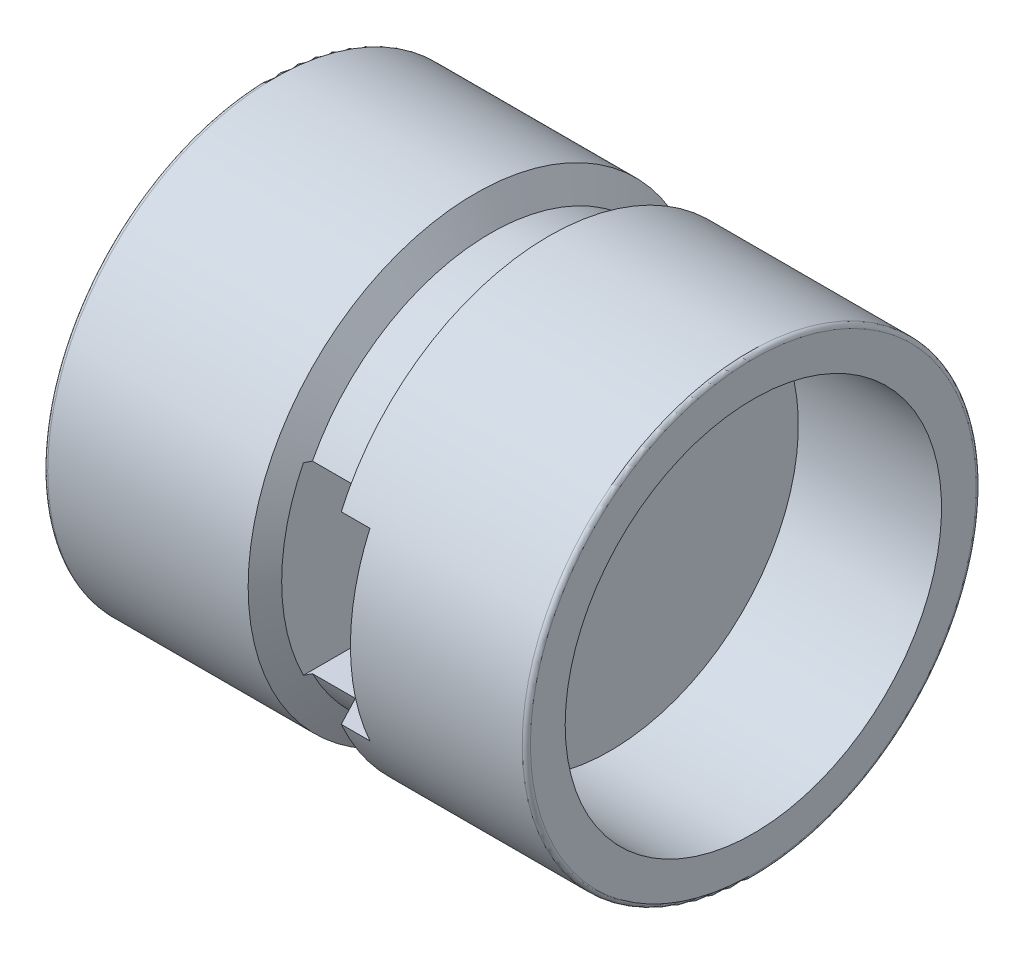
ISO-10303-21;
HEADER;
FILE_DESCRIPTION(('STEP AP214'),'2;1');
FILE_NAME('part.step','',(''),(''),'','','');
FILE_SCHEMA(('AUTOMOTIVE_DESIGN { 1 0 10303 214 1 1 1 1 }'));
ENDSEC;
DATA;
#1=APPLICATION_CONTEXT('core data for automotive mechanical design processes');
#2=APPLICATION_PROTOCOL_DEFINITION('international standard','automotive_design',2000,#1);
#3=PRODUCT_CONTEXT('',#1,'mechanical');
#4=PRODUCT('Part','Part','',(#3));
#5=PRODUCT_RELATED_PRODUCT_CATEGORY('part','',(#4));
#6=PRODUCT_DEFINITION_FORMATION('','',#4);
#7=PRODUCT_DEFINITION_CONTEXT('part definition',#1,'design');
#8=PRODUCT_DEFINITION('design','',#6,#7);
#9=PRODUCT_DEFINITION_SHAPE('','',#8);
#10=(LENGTH_UNIT() NAMED_UNIT(*) SI_UNIT(.MILLI.,.METRE.));
#11=(NAMED_UNIT(*) PLANE_ANGLE_UNIT() SI_UNIT($,.RADIAN.));
#12=(NAMED_UNIT(*) SI_UNIT($,.STERADIAN.) SOLID_ANGLE_UNIT());
#13=UNCERTAINTY_MEASURE_WITH_UNIT(LENGTH_MEASURE(1.E-05),#10,'distance_accuracy_value','');
#14=(GEOMETRIC_REPRESENTATION_CONTEXT(3) GLOBAL_UNCERTAINTY_ASSIGNED_CONTEXT((#13)) GLOBAL_UNIT_ASSIGNED_CONTEXT((#10,
#11,#12)) REPRESENTATION_CONTEXT('',''));
#15=CARTESIAN_POINT('',(0.,0.,0.));
#16=DIRECTION('',(0.,0.,1.));
#17=DIRECTION('',(1.,0.,0.));
#18=AXIS2_PLACEMENT_3D('',#15,#16,#17);
#19=CARTESIAN_POINT('',(0.,0.,0.));
#20=DIRECTION('',(-1.,0.,0.));
#21=DIRECTION('',(0.,0.,1.));
#22=AXIS2_PLACEMENT_3D('',#19,#20,#21);
#23=CYLINDRICAL_SURFACE('',#22,4.9);
#24=CARTESIAN_POINT('',(-2.19348149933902,0.,0.));
#25=DIRECTION('',(-1.,0.,0.));
#26=DIRECTION('',(0.,0.,1.));
#27=AXIS2_PLACEMENT_3D('',#24,#25,#26);
#28=CIRCLE('',#27,4.9);
#29=CARTESIAN_POINT('',(-2.19348149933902,2.25,4.35287261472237));
#30=VERTEX_POINT('',#29);
#31=CARTESIAN_POINT('',(-2.19348149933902,2.25,-4.35287261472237));
#32=VERTEX_POINT('',#31);
#33=EDGE_CURVE('E501',#30,#32,#28,.T.);
#34=ORIENTED_EDGE('',*,*,#33,.T.);
#35=DIRECTION('',(-1.,0.,0.));
#36=VECTOR('',#35,1.);
#37=CARTESIAN_POINT('',(0.,2.25,-4.35287261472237));
#38=LINE('',#37,#36);
#39=CARTESIAN_POINT('',(-3.24292614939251,2.25,-4.35287261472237));
#40=VERTEX_POINT('',#39);
#41=EDGE_CURVE('E460',#32,#40,#38,.T.);
#42=ORIENTED_EDGE('',*,*,#41,.T.);
#43=CARTESIAN_POINT('',(-3.24292614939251,0.,0.));
#44=DIRECTION('',(-1.,0.,0.));
#45=DIRECTION('',(0.,0.,1.));
#46=AXIS2_PLACEMENT_3D('',#43,#44,#45);
#47=CIRCLE('',#46,4.9);
#48=CARTESIAN_POINT('',(-3.24292614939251,2.25,4.35287261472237));
#49=VERTEX_POINT('',#48);
#50=EDGE_CURVE('E510',#49,#40,#47,.T.);
#51=ORIENTED_EDGE('',*,*,#50,.F.);
#52=DIRECTION('',(-1.,0.,0.));
#53=VECTOR('',#52,1.);
#54=CARTESIAN_POINT('',(0.,2.25,4.35287261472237));
#55=LINE('',#54,#53);
#56=EDGE_CURVE('E426',#30,#49,#55,.T.);
#57=ORIENTED_EDGE('',*,*,#56,.F.);
#58=EDGE_LOOP('',(#34,#42,#51,#57));
#59=FACE_BOUND('',#58,.T.);
#60=ADVANCED_FACE('F26',(#59),#23,.T.);
#61=CARTESIAN_POINT('',(-1.81820382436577,0.,0.));
#62=DIRECTION('',(1.,0.,0.));
#63=DIRECTION('',(0.,0.,-1.));
#64=AXIS2_PLACEMENT_3D('',#61,#62,#63);
#65=CONICAL_SURFACE('',#64,5.55,1.0471975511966);
#66=CARTESIAN_POINT('',(-1.81820382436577,0.,0.));
#67=DIRECTION('',(-1.,0.,0.));
#68=DIRECTION('',(0.,0.,1.));
#69=AXIS2_PLACEMENT_3D('',#66,#67,#68);
#70=CIRCLE('',#69,5.55);
#71=CARTESIAN_POINT('',(-1.81820382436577,2.25,5.07346035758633));
#72=VERTEX_POINT('',#71);
#73=CARTESIAN_POINT('',(-1.81820382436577,2.25,-5.07346035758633));
#74=VERTEX_POINT('',#73);
#75=EDGE_CURVE('E502',#72,#74,#70,.T.);
#76=ORIENTED_EDGE('',*,*,#75,.T.);
#77=CARTESIAN_POINT('',(0.270754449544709,2.25,-8.88780393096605));
#78=CARTESIAN_POINT('',(0.161932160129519,2.25,-8.69336922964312));
#79=CARTESIAN_POINT('',(0.0532703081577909,2.25,-8.49884492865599));
#80=CARTESIAN_POINT('',(-0.163654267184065,2.25,-8.10957244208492));
#81=CARTESIAN_POINT('',(-0.271916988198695,2.25,-7.91482425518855));
#82=CARTESIAN_POINT('',(-0.596044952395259,2.25,-7.33007599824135));
#83=CARTESIAN_POINT('',(-0.811191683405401,2.25,-6.93967622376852));
#84=CARTESIAN_POINT('',(-1.13158702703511,2.25,-6.35287583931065));
#85=CARTESIAN_POINT('',(-1.23798371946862,2.25,-6.15710226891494));
#86=CARTESIAN_POINT('',(-1.44977405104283,2.25,-5.76501361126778));
#87=CARTESIAN_POINT('',(-1.55516769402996,2.25,-5.56869852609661));
#88=CARTESIAN_POINT('',(-1.76461667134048,2.25,-5.17538821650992));
#89=CARTESIAN_POINT('',(-1.86867218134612,2.25,-4.97839308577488));
#90=CARTESIAN_POINT('',(-2.07498223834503,2.25,-4.58346311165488));
#91=CARTESIAN_POINT('',(-2.1772368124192,2.25,-4.3855282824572));
#92=CARTESIAN_POINT('',(-2.37854920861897,2.25,-3.98968914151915));
#93=CARTESIAN_POINT('',(-2.4776237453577,2.25,-3.79179334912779));
#94=CARTESIAN_POINT('',(-2.67219277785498,2.25,-3.39418853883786));
#95=CARTESIAN_POINT('',(-2.76768661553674,2.25,-3.19447919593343));
#96=CARTESIAN_POINT('',(-2.90700747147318,2.25,-2.89258190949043));
#97=CARTESIAN_POINT('',(-2.95288781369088,2.25,-2.79134278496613));
#98=CARTESIAN_POINT('',(-3.04289773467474,2.25,-2.58809092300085));
#99=CARTESIAN_POINT('',(-3.08702737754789,2.25,-2.48607821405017));
#100=CARTESIAN_POINT('',(-3.17306992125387,2.25,-2.28113966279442));
#101=CARTESIAN_POINT('',(-3.21498323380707,2.25,-2.17821399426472));
#102=CARTESIAN_POINT('',(-3.29598080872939,2.25,-1.97126042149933));
#103=CARTESIAN_POINT('',(-3.33506529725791,2.25,-1.86723260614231));
#104=CARTESIAN_POINT('',(-3.41888066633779,2.25,-1.63183200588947));
#105=CARTESIAN_POINT('',(-3.46259839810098,2.25,-1.50009276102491));
#106=CARTESIAN_POINT('',(-3.5422994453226,2.25,-1.23424148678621));
#107=CARTESIAN_POINT('',(-3.57828238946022,2.25,-1.10012934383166));
#108=CARTESIAN_POINT('',(-3.63952675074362,2.25,-0.830920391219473));
#109=CARTESIAN_POINT('',(-3.66489887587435,2.25,-0.695849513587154));
#110=CARTESIAN_POINT('',(-3.70279088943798,2.25,-0.423927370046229));
#111=CARTESIAN_POINT('',(-3.71531833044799,2.25,-0.287077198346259));
#112=CARTESIAN_POINT('',(-3.7258896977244,2.25,-0.0114706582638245));
#113=CARTESIAN_POINT('',(-3.72379298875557,2.25,0.127291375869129));
#114=CARTESIAN_POINT('',(-3.70509179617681,2.25,0.403847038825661));
#115=CARTESIAN_POINT('',(-3.68848117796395,2.25,0.541640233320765));
#116=CARTESIAN_POINT('',(-3.64257210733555,2.25,0.817203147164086));
#117=CARTESIAN_POINT('',(-3.61308198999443,2.25,0.954939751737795));
#118=CARTESIAN_POINT('',(-3.54430732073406,2.25,1.22790492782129));
#119=CARTESIAN_POINT('',(-3.50502070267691,2.25,1.36313296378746));
#120=CARTESIAN_POINT('',(-3.41066578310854,2.25,1.65816542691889));
#121=CARTESIAN_POINT('',(-3.3540125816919,2.25,1.8174545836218));
#122=CARTESIAN_POINT('',(-3.23368108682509,2.25,2.1333441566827));
#123=CARTESIAN_POINT('',(-3.17000123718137,2.25,2.28994396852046));
#124=CARTESIAN_POINT('',(-3.03998303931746,2.25,2.59594895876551));
#125=CARTESIAN_POINT('',(-2.97380131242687,2.25,2.74542123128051));
#126=CARTESIAN_POINT('',(-2.87214540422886,2.25,2.96843531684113));
#127=CARTESIAN_POINT('',(-2.83788219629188,2.25,3.04253424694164));
#128=CARTESIAN_POINT('',(-2.76866363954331,2.25,3.19040325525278));
#129=CARTESIAN_POINT('',(-2.73370832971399,2.25,3.26417335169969));
#130=CARTESIAN_POINT('',(-2.69846145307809,2.25,3.33780393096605));
#131=B_SPLINE_CURVE_WITH_KNOTS('',3,(#77,#78,#79,#80,#81,#82,#83,#84,#85,#86,#87,#88,#89,#90,
#91,#92,#93,#94,#95,#96,#97,#98,#99,#100,#101,#102,#103,#104,#105,#106,#107,#108,#109,#110,#111,
#112,#113,#114,#115,#116,#117,#118,#119,#120,#121,#122,#123,#124,#125,#126,#127,#128,#129,#130),
.UNSPECIFIED.,.F.,.F.,(4,2,2,2,2,2,2,2,2,2,2,2,2,2,2,2,2,2,2,2,2,2,2,2,2,2,4),(0.,
0.66844865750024,1.33690125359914,2.67416412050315,3.34261395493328,4.0110612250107,
4.67941982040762,5.34776835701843,6.01168031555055,6.67571369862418,7.00915174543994,
7.3425775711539,7.67594123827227,8.00927822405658,8.42551526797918,8.84177228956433,
9.25357087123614,9.66512717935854,10.0806466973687,10.4963419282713,10.9184460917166,
11.3406393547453,11.8475767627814,12.3546266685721,12.844977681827,13.0898864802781,
13.3347815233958),.UNSPECIFIED.);
#132=EDGE_CURVE('E467',#74,#32,#131,.T.);
#133=ORIENTED_EDGE('',*,*,#132,.T.);
#134=ORIENTED_EDGE('',*,*,#33,.F.);
#135=CARTESIAN_POINT('',(0.270754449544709,2.25,8.88780393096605));
#136=CARTESIAN_POINT('',(0.161932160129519,2.25,8.69336922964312));
#137=CARTESIAN_POINT('',(0.0532703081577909,2.25,8.49884492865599));
#138=CARTESIAN_POINT('',(-0.163654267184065,2.25,8.10957244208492));
#139=CARTESIAN_POINT('',(-0.271916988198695,2.25,7.91482425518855));
#140=CARTESIAN_POINT('',(-0.596044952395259,2.25,7.33007599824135));
#141=CARTESIAN_POINT('',(-0.811191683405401,2.25,6.93967622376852));
#142=CARTESIAN_POINT('',(-1.13158702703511,2.25,6.35287583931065));
#143=CARTESIAN_POINT('',(-1.23798371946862,2.25,6.15710226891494));
#144=CARTESIAN_POINT('',(-1.44977405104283,2.25,5.76501361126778));
#145=CARTESIAN_POINT('',(-1.55516769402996,2.25,5.56869852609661));
#146=CARTESIAN_POINT('',(-1.76461667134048,2.25,5.17538821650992));
#147=CARTESIAN_POINT('',(-1.86867218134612,2.25,4.97839308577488));
#148=CARTESIAN_POINT('',(-2.07498223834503,2.25,4.58346311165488));
#149=CARTESIAN_POINT('',(-2.1772368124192,2.25,4.3855282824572));
#150=CARTESIAN_POINT('',(-2.37854920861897,2.25,3.98968914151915));
#151=CARTESIAN_POINT('',(-2.4776237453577,2.25,3.79179334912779));
#152=CARTESIAN_POINT('',(-2.67219277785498,2.25,3.39418853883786));
#153=CARTESIAN_POINT('',(-2.76768661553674,2.25,3.19447919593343));
#154=CARTESIAN_POINT('',(-2.90700747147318,2.25,2.89258190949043));
#155=CARTESIAN_POINT('',(-2.95288781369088,2.25,2.79134278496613));
#156=CARTESIAN_POINT('',(-3.04289773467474,2.25,2.58809092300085));
#157=CARTESIAN_POINT('',(-3.08702737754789,2.25,2.48607821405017));
#158=CARTESIAN_POINT('',(-3.17306992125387,2.25,2.28113966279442));
#159=CARTESIAN_POINT('',(-3.21498323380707,2.25,2.17821399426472));
#160=CARTESIAN_POINT('',(-3.29598080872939,2.25,1.97126042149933));
#161=CARTESIAN_POINT('',(-3.33506529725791,2.25,1.86723260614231));
#162=CARTESIAN_POINT('',(-3.41888066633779,2.25,1.63183200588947));
#163=CARTESIAN_POINT('',(-3.46259839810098,2.25,1.50009276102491));
#164=CARTESIAN_POINT('',(-3.5422994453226,2.25,1.23424148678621));
#165=CARTESIAN_POINT('',(-3.57828238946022,2.25,1.10012934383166));
#166=CARTESIAN_POINT('',(-3.63952675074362,2.25,0.830920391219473));
#167=CARTESIAN_POINT('',(-3.66489887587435,2.25,0.695849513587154));
#168=CARTESIAN_POINT('',(-3.70279088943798,2.25,0.423927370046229));
#169=CARTESIAN_POINT('',(-3.71531833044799,2.25,0.287077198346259));
#170=CARTESIAN_POINT('',(-3.7258896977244,2.25,0.0114706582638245));
#171=CARTESIAN_POINT('',(-3.72379298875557,2.25,-0.127291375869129));
#172=CARTESIAN_POINT('',(-3.70509179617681,2.25,-0.403847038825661));
#173=CARTESIAN_POINT('',(-3.68848117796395,2.25,-0.541640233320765));
#174=CARTESIAN_POINT('',(-3.64257210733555,2.25,-0.817203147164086));
#175=CARTESIAN_POINT('',(-3.61308198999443,2.25,-0.954939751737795));
#176=CARTESIAN_POINT('',(-3.54430732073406,2.25,-1.22790492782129));
#177=CARTESIAN_POINT('',(-3.50502070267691,2.25,-1.36313296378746));
#178=CARTESIAN_POINT('',(-3.41066578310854,2.25,-1.65816542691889));
#179=CARTESIAN_POINT('',(-3.3540125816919,2.25,-1.8174545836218));
#180=CARTESIAN_POINT('',(-3.23368108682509,2.25,-2.1333441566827));
#181=CARTESIAN_POINT('',(-3.17000123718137,2.25,-2.28994396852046));
#182=CARTESIAN_POINT('',(-3.03998303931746,2.25,-2.59594895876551));
#183=CARTESIAN_POINT('',(-2.97380131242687,2.25,-2.74542123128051));
#184=CARTESIAN_POINT('',(-2.87214540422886,2.25,-2.96843531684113));
#185=CARTESIAN_POINT('',(-2.83788219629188,2.25,-3.04253424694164));
#186=CARTESIAN_POINT('',(-2.76866363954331,2.25,-3.19040325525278));
#187=CARTESIAN_POINT('',(-2.73370832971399,2.25,-3.26417335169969));
#188=CARTESIAN_POINT('',(-2.69846145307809,2.25,-3.33780393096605));
#189=B_SPLINE_CURVE_WITH_KNOTS('',3,(#135,#136,#137,#138,#139,#140,#141,#142,#143,#144,#145,
#146,#147,#148,#149,#150,#151,#152,#153,#154,#155,#156,#157,#158,#159,#160,#161,#162,#163,#164,
#165,#166,#167,#168,#169,#170,#171,#172,#173,#174,#175,#176,#177,#178,#179,#180,#181,#182,#183,
#184,#185,#186,#187,#188),.UNSPECIFIED.,.F.,.F.,(4,2,2,2,2,2,2,2,2,2,2,2,2,2,2,2,2,2,2,2,2,2,2,
2,2,2,4),(0.,0.66844865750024,1.33690125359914,2.67416412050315,3.34261395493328,
4.0110612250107,4.67941982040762,5.34776835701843,6.01168031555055,6.67571369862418,
7.00915174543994,7.3425775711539,7.67594123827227,8.00927822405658,8.42551526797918,
8.84177228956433,9.25357087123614,9.66512717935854,10.0806466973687,10.4963419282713,
10.9184460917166,11.3406393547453,11.8475767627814,12.3546266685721,12.844977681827,
13.0898864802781,13.3347815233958),.UNSPECIFIED.);
#190=EDGE_CURVE('E430',#72,#30,#189,.T.);
#191=ORIENTED_EDGE('',*,*,#190,.F.);
#192=EDGE_LOOP('',(#76,#133,#134,#191));
#193=FACE_BOUND('',#192,.T.);
#194=ADVANCED_FACE('F577',(#193),#65,.T.);
#195=CARTESIAN_POINT('',(-2.11820382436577,1.65,0.));
#196=DIRECTION('',(-1.,0.,0.));
#197=DIRECTION('',(0.,0.,1.));
#198=AXIS2_PLACEMENT_3D('',#195,#196,#197);
#199=PLANE('',#198);
#200=DIRECTION('',(0.,0.,1.));
#201=VECTOR('',#200,1.);
#202=CARTESIAN_POINT('',(-2.11820382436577,2.25,0.));
#203=LINE('',#202,#201);
#204=CARTESIAN_POINT('',(-2.11820382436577,2.25,-3.));
#205=VERTEX_POINT('',#204);
#206=CARTESIAN_POINT('',(-2.11820382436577,2.25,3.));
#207=VERTEX_POINT('',#206);
#208=EDGE_CURVE('E530',#205,#207,#203,.T.);
#209=ORIENTED_EDGE('',*,*,#208,.F.);
#210=CARTESIAN_POINT('',(-2.11820382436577,0.,0.));
#211=DIRECTION('',(-1.,0.,0.));
#212=DIRECTION('',(0.,0.,1.));
#213=AXIS2_PLACEMENT_3D('',#210,#211,#212);
#214=CIRCLE('',#213,3.75);
#215=EDGE_CURVE('E690',#207,#205,#214,.T.);
#216=ORIENTED_EDGE('',*,*,#215,.F.);
#217=EDGE_LOOP('',(#209,#216));
#218=FACE_BOUND('',#217,.T.);
#219=ADVANCED_FACE('F377',(#218),#199,.F.);
#220=CARTESIAN_POINT('',(-3.24292614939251,0.,0.));
#221=DIRECTION('',(-1.,0.,0.));
#222=DIRECTION('',(0.,0.,1.));
#223=AXIS2_PLACEMENT_3D('',#220,#221,#222);
#224=CONICAL_SURFACE('',#223,4.9,1.0471975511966);
#225=CARTESIAN_POINT('',(-3.61820382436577,0.,0.));
#226=DIRECTION('',(-1.,0.,0.));
#227=DIRECTION('',(0.,0.,1.));
#228=AXIS2_PLACEMENT_3D('',#225,#226,#227);
#229=CIRCLE('',#228,5.55);
#230=CARTESIAN_POINT('',(-3.61820382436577,0.,5.55));
#231=VERTEX_POINT('',#230);
#232=EDGE_CURVE('E512',#231,#231,#229,.T.);
#233=ORIENTED_EDGE('',*,*,#232,.F.);
#234=EDGE_LOOP('',(#233));
#235=FACE_BOUND('',#234,.T.);
#236=ORIENTED_EDGE('',*,*,#50,.T.);
#237=CARTESIAN_POINT('',(-2.73445374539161,2.25,3.33050629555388));
#238=CARTESIAN_POINT('',(-2.69421859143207,2.25,3.24638894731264));
#239=CARTESIAN_POINT('',(-2.65435976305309,2.25,3.16208945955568));
#240=CARTESIAN_POINT('',(-2.57556992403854,2.25,2.99304807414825));
#241=CARTESIAN_POINT('',(-2.53663900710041,2.25,2.90830613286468));
#242=CARTESIAN_POINT('',(-2.45978616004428,2.25,2.73809233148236));
#243=CARTESIAN_POINT('',(-2.4218671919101,2.25,2.65261912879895));
#244=CARTESIAN_POINT('',(-2.34739473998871,2.25,2.48108338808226));
#245=CARTESIAN_POINT('',(-2.31084122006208,2.25,2.395020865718));
#246=CARTESIAN_POINT('',(-2.2014565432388,2.25,2.13050159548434));
#247=CARTESIAN_POINT('',(-2.13129575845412,2.25,1.95092292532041));
#248=CARTESIAN_POINT('',(-2.00176002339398,2.25,1.58796919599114));
#249=CARTESIAN_POINT('',(-1.94237527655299,2.25,1.40459775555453));
#250=CARTESIAN_POINT('',(-1.85716438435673,2.25,1.09467310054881));
#251=CARTESIAN_POINT('',(-1.82673679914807,2.25,0.969405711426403));
#252=CARTESIAN_POINT('',(-1.77558457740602,2.25,0.716885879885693));
#253=CARTESIAN_POINT('',(-1.75485691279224,2.25,0.589634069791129));
#254=CARTESIAN_POINT('',(-1.72538418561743,2.25,0.335580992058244));
#255=CARTESIAN_POINT('',(-1.71646939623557,2.25,0.208800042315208));
#256=CARTESIAN_POINT('',(-1.7111461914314,2.25,-0.0450423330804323));
#257=CARTESIAN_POINT('',(-1.71473729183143,2.25,-0.172103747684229));
#258=CARTESIAN_POINT('',(-1.73031324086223,2.25,-0.37733888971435));
#259=CARTESIAN_POINT('',(-1.73860763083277,2.25,-0.455817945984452));
#260=CARTESIAN_POINT('',(-1.7594608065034,2.25,-0.612210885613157));
#261=CARTESIAN_POINT('',(-1.77202003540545,2.25,-0.690124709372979));
#262=CARTESIAN_POINT('',(-1.81541352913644,2.25,-0.922890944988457));
#263=CARTESIAN_POINT('',(-1.85195688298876,2.25,-1.07669074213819));
#264=CARTESIAN_POINT('',(-1.91567341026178,2.25,-1.30693628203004));
#265=CARTESIAN_POINT('',(-1.93874653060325,2.25,-1.38458690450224));
#266=CARTESIAN_POINT('',(-1.98735581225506,2.25,-1.53912079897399));
#267=CARTESIAN_POINT('',(-2.0128919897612,2.25,-1.61600406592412));
#268=CARTESIAN_POINT('',(-2.06600278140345,2.25,-1.76903184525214));
#269=CARTESIAN_POINT('',(-2.09357680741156,2.25,-1.84517656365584));
#270=CARTESIAN_POINT('',(-2.15042767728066,2.25,-1.99682242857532));
#271=CARTESIAN_POINT('',(-2.17970446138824,2.25,-2.07232359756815));
#272=CARTESIAN_POINT('',(-2.27243257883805,2.25,-2.3049617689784));
#273=CARTESIAN_POINT('',(-2.33826785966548,2.25,-2.46114792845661));
#274=CARTESIAN_POINT('',(-2.47420144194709,2.25,-2.77166185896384));
#275=CARTESIAN_POINT('',(-2.54430048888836,2.25,-2.92598929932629));
#276=CARTESIAN_POINT('',(-2.68756614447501,2.25,-3.23330361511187));
#277=CARTESIAN_POINT('',(-2.76073428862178,2.25,-3.38628977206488));
#278=CARTESIAN_POINT('',(-2.90928407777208,2.25,-3.69118611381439));
#279=CARTESIAN_POINT('',(-2.98466580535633,2.25,-3.84309625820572));
#280=CARTESIAN_POINT('',(-3.13723241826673,2.25,-4.14638454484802));
#281=CARTESIAN_POINT('',(-3.21442058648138,2.25,-4.2977610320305));
#282=CARTESIAN_POINT('',(-3.37006675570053,2.25,-4.59986046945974));
#283=CARTESIAN_POINT('',(-3.44852476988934,2.25,-4.75058341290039));
#284=CARTESIAN_POINT('',(-3.68531268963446,2.25,-5.20188591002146));
#285=CARTESIAN_POINT('',(-3.84510621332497,2.25,-5.50169700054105));
#286=CARTESIAN_POINT('',(-4.14528712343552,2.25,-6.05934279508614));
#287=CARTESIAN_POINT('',(-4.28536167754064,2.25,-6.31734669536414));
#288=CARTESIAN_POINT('',(-4.56684858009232,2.25,-6.83265457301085));
#289=CARTESIAN_POINT('',(-4.70826105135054,2.25,-7.08995848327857));
#290=CARTESIAN_POINT('',(-4.99150566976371,2.25,-7.60304440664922));
#291=CARTESIAN_POINT('',(-5.13333411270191,2.25,-7.85882846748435));
#292=CARTESIAN_POINT('',(-5.4177145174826,2.25,-8.3699590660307));
#293=CARTESIAN_POINT('',(-5.56026640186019,2.25,-8.62530564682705));
#294=CARTESIAN_POINT('',(-5.70307775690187,2.25,-8.88050629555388));
#295=B_SPLINE_CURVE_WITH_KNOTS('',3,(#237,#238,#239,#240,#241,#242,#243,#244,#245,#246,#247,
#248,#249,#250,#251,#252,#253,#254,#255,#256,#257,#258,#259,#260,#261,#262,#263,#264,#265,#266,
#267,#268,#269,#270,#271,#272,#273,#274,#275,#276,#277,#278,#279,#280,#281,#282,#283,#284,#285,
#286,#287,#288,#289,#290,#291,#292,#293,#294),.UNSPECIFIED.,.F.,.F.,(4,2,2,2,2,2,2,2,2,2,2,2,2,
2,2,2,2,2,2,2,2,2,2,2,2,2,2,2,4),(0.,0.279736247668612,0.559500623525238,0.840009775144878,
1.12051149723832,1.69870623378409,2.27637266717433,2.66281093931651,3.0491284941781,
3.42983300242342,3.81052277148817,4.04715723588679,4.28381629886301,4.75736632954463,
5.00036287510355,5.24336101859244,5.48628930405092,5.72920906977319,6.23758599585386,
6.74605206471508,7.25477563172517,7.76351820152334,8.27327084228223,8.783028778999,
9.8022153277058,10.6829398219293,11.563745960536,12.4411654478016,13.3184928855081),.UNSPECIFIED.);
#296=CARTESIAN_POINT('',(-3.31820382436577,2.25,-4.49914111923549));
#297=VERTEX_POINT('',#296);
#298=EDGE_CURVE('E454',#40,#297,#295,.T.);
#299=ORIENTED_EDGE('',*,*,#298,.T.);
#300=CARTESIAN_POINT('',(-3.31820382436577,0.,0.));
#301=DIRECTION('',(-1.,0.,0.));
#302=DIRECTION('',(0.,-1.,0.));
#303=AXIS2_PLACEMENT_3D('',#300,#301,#302);
#304=CIRCLE('',#303,5.03038475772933);
#305=CARTESIAN_POINT('',(-3.31820382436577,-2.25,-4.49914111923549));
#306=VERTEX_POINT('',#305);
#307=EDGE_CURVE('E370',#297,#306,#304,.T.);
#308=ORIENTED_EDGE('',*,*,#307,.T.);
#309=CARTESIAN_POINT('',(-5.70307775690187,-2.25,-8.88050629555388));
#310=CARTESIAN_POINT('',(-5.59434663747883,-2.25,-8.68622486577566));
#311=CARTESIAN_POINT('',(-5.48577607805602,-2.25,-8.49185377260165));
#312=CARTESIAN_POINT('',(-5.26903438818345,-2.25,-8.10288754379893));
#313=CARTESIAN_POINT('',(-5.16086326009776,-2.25,-7.90829240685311));
#314=CARTESIAN_POINT('',(-4.83701051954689,-2.25,-7.32400285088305));
#315=CARTESIAN_POINT('',(-4.62204795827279,-2.25,-6.93390845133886));
#316=CARTESIAN_POINT('',(-4.30192477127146,-2.25,-6.3475547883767));
#317=CARTESIAN_POINT('',(-4.19561527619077,-2.25,-6.15192294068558));
#318=CARTESIAN_POINT('',(-3.98400016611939,-2.25,-5.76011733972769));
#319=CARTESIAN_POINT('',(-3.8786945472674,-2.25,-5.56394358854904));
#320=CARTESIAN_POINT('',(-3.66942271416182,-2.25,-5.17091549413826));
#321=CARTESIAN_POINT('',(-3.5654563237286,-2.25,-4.97406124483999));
#322=CARTESIAN_POINT('',(-3.35932594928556,-2.25,-4.57941243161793));
#323=CARTESIAN_POINT('',(-3.25716193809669,-2.25,-4.38161788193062));
#324=CARTESIAN_POINT('',(-3.05602383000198,-2.25,-3.98604154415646));
#325=CARTESIAN_POINT('',(-2.95703320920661,-2.25,-3.7882681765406));
#326=CARTESIAN_POINT('',(-2.76263532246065,-2.25,-3.3909069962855));
#327=CARTESIAN_POINT('',(-2.66722871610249,-2.25,-3.19131885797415));
#328=CARTESIAN_POINT('',(-2.52804350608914,-2.25,-2.88960476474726));
#329=CARTESIAN_POINT('',(-2.48220973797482,-2.25,-2.78842813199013));
#330=CARTESIAN_POINT('',(-2.39229435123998,-2.25,-2.58530098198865));
#331=CARTESIAN_POINT('',(-2.34821266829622,-2.25,-2.48335049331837));
#332=CARTESIAN_POINT('',(-2.26226763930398,-2.25,-2.2785361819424));
#333=CARTESIAN_POINT('',(-2.2204038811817,-2.25,-2.17567253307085));
#334=CARTESIAN_POINT('',(-2.13950719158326,-2.25,-1.9688430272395));
#335=CARTESIAN_POINT('',(-2.10047403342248,-2.25,-1.86487725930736));
#336=CARTESIAN_POINT('',(-2.01676383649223,-2.25,-1.62958218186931));
#337=CARTESIAN_POINT('',(-1.9731019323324,-2.25,-1.49788597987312));
#338=CARTESIAN_POINT('',(-1.89351912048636,-2.25,-1.23212165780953));
#339=CARTESIAN_POINT('',(-1.8575985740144,-2.25,-1.09805342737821));
#340=CARTESIAN_POINT('',(-1.79648309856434,-2.25,-0.828932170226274));
#341=CARTESIAN_POINT('',(-1.77117760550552,-2.25,-0.69390499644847));
#342=CARTESIAN_POINT('',(-1.7334195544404,-2.25,-0.422075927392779));
#343=CARTESIAN_POINT('',(-1.72095945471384,-2.25,-0.285275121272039));
#344=CARTESIAN_POINT('',(-1.71051517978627,-2.25,-0.00978207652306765));
#345=CARTESIAN_POINT('',(-1.71267079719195,-2.25,0.128915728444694));
#346=CARTESIAN_POINT('',(-1.73147119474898,-2.25,0.405338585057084));
#347=CARTESIAN_POINT('',(-1.74812212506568,-2.25,0.543063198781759));
#348=CARTESIAN_POINT('',(-1.79409122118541,-2.25,0.818481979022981));
#349=CARTESIAN_POINT('',(-1.82360022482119,-2.25,0.956143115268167));
#350=CARTESIAN_POINT('',(-1.89239497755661,-2.25,1.22895960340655));
#351=CARTESIAN_POINT('',(-1.93168276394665,-2.25,1.3641144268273));
#352=CARTESIAN_POINT('',(-2.02581465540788,-2.25,1.65832487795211));
#353=CARTESIAN_POINT('',(-2.08219848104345,-2.25,1.81687971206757));
#354=CARTESIAN_POINT('',(-2.20193447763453,-2.25,2.13132302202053));
#355=CARTESIAN_POINT('',(-2.26528815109,-2.25,2.2872109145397));
#356=CARTESIAN_POINT('',(-2.39464520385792,-2.25,2.59185653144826));
#357=CARTESIAN_POINT('',(-2.46049377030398,-2.25,2.74068053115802));
#358=CARTESIAN_POINT('',(-2.56163882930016,-2.25,2.96272989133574));
#359=CARTESIAN_POINT('',(-2.59573026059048,-2.25,3.03650924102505));
#360=CARTESIAN_POINT('',(-2.66460224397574,-2.25,3.18374078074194));
#361=CARTESIAN_POINT('',(-2.69938275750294,-2.25,3.25719298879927));
#362=CARTESIAN_POINT('',(-2.73445374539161,-2.25,3.33050629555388));
#363=B_SPLINE_CURVE_WITH_KNOTS('',3,(#309,#310,#311,#312,#313,#314,#315,#316,#317,#318,#319,
#320,#321,#322,#323,#324,#325,#326,#327,#328,#329,#330,#331,#332,#333,#334,#335,#336,#337,#338,
#339,#340,#341,#342,#343,#344,#345,#346,#347,#348,#349,#350,#351,#352,#353,#354,#355,#356,#357,
#358,#359,#360,#361,#362),.UNSPECIFIED.,.F.,.F.,(4,2,2,2,2,2,2,2,2,2,2,2,2,2,2,2,2,2,2,2,2,2,2,
2,2,2,4),(0.,0.66791383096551,1.33583160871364,2.67202542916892,3.33997678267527,4.007925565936,
4.67578556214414,5.34363547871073,6.00710627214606,6.67069857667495,7.00390816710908,
7.33710551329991,7.67024073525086,8.00334924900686,8.41941062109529,8.83549140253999,
9.24712377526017,9.65851433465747,10.0738451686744,10.4893523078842,10.9112483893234,
11.3332324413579,11.837827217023,12.3425309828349,12.8306994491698,13.0745217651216,
13.3183304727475),.UNSPECIFIED.);
#364=CARTESIAN_POINT('',(-3.24292614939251,-2.25,-4.35287261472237));
#365=VERTEX_POINT('',#364);
#366=EDGE_CURVE('E363',#306,#365,#363,.T.);
#367=ORIENTED_EDGE('',*,*,#366,.T.);
#368=CARTESIAN_POINT('',(-3.24292614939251,-2.25,4.35287261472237));
#369=VERTEX_POINT('',#368);
#370=EDGE_CURVE('E497',#365,#369,#47,.T.);
#371=ORIENTED_EDGE('',*,*,#370,.T.);
#372=CARTESIAN_POINT('',(-5.70307775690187,-2.25,8.88050629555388));
#373=CARTESIAN_POINT('',(-5.59434663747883,-2.25,8.68622486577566));
#374=CARTESIAN_POINT('',(-5.48577607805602,-2.25,8.49185377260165));
#375=CARTESIAN_POINT('',(-5.26903438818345,-2.25,8.10288754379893));
#376=CARTESIAN_POINT('',(-5.16086326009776,-2.25,7.90829240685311));
#377=CARTESIAN_POINT('',(-4.83701051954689,-2.25,7.32400285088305));
#378=CARTESIAN_POINT('',(-4.62204795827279,-2.25,6.93390845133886));
#379=CARTESIAN_POINT('',(-4.30192477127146,-2.25,6.3475547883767));
#380=CARTESIAN_POINT('',(-4.19561527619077,-2.25,6.15192294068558));
#381=CARTESIAN_POINT('',(-3.98400016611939,-2.25,5.76011733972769));
#382=CARTESIAN_POINT('',(-3.8786945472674,-2.25,5.56394358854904));
#383=CARTESIAN_POINT('',(-3.66942271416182,-2.25,5.17091549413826));
#384=CARTESIAN_POINT('',(-3.5654563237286,-2.25,4.97406124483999));
#385=CARTESIAN_POINT('',(-3.35932594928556,-2.25,4.57941243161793));
#386=CARTESIAN_POINT('',(-3.25716193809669,-2.25,4.38161788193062));
#387=CARTESIAN_POINT('',(-3.05602383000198,-2.25,3.98604154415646));
#388=CARTESIAN_POINT('',(-2.95703320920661,-2.25,3.7882681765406));
#389=CARTESIAN_POINT('',(-2.76263532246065,-2.25,3.3909069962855));
#390=CARTESIAN_POINT('',(-2.66722871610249,-2.25,3.19131885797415));
#391=CARTESIAN_POINT('',(-2.52804350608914,-2.25,2.88960476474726));
#392=CARTESIAN_POINT('',(-2.48220973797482,-2.25,2.78842813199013));
#393=CARTESIAN_POINT('',(-2.39229435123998,-2.25,2.58530098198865));
#394=CARTESIAN_POINT('',(-2.34821266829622,-2.25,2.48335049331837));
#395=CARTESIAN_POINT('',(-2.26226763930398,-2.25,2.2785361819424));
#396=CARTESIAN_POINT('',(-2.2204038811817,-2.25,2.17567253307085));
#397=CARTESIAN_POINT('',(-2.13950719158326,-2.25,1.9688430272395));
#398=CARTESIAN_POINT('',(-2.10047403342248,-2.25,1.86487725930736));
#399=CARTESIAN_POINT('',(-2.01676383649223,-2.25,1.62958218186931));
#400=CARTESIAN_POINT('',(-1.9731019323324,-2.25,1.49788597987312));
#401=CARTESIAN_POINT('',(-1.89351912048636,-2.25,1.23212165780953));
#402=CARTESIAN_POINT('',(-1.8575985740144,-2.25,1.09805342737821));
#403=CARTESIAN_POINT('',(-1.79648309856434,-2.25,0.828932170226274));
#404=CARTESIAN_POINT('',(-1.77117760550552,-2.25,0.69390499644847));
#405=CARTESIAN_POINT('',(-1.7334195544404,-2.25,0.422075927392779));
#406=CARTESIAN_POINT('',(-1.72095945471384,-2.25,0.285275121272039));
#407=CARTESIAN_POINT('',(-1.71051517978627,-2.25,0.00978207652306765));
#408=CARTESIAN_POINT('',(-1.71267079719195,-2.25,-0.128915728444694));
#409=CARTESIAN_POINT('',(-1.73147119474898,-2.25,-0.405338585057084));
#410=CARTESIAN_POINT('',(-1.74812212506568,-2.25,-0.543063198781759));
#411=CARTESIAN_POINT('',(-1.79409122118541,-2.25,-0.818481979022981));
#412=CARTESIAN_POINT('',(-1.82360022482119,-2.25,-0.956143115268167));
#413=CARTESIAN_POINT('',(-1.89239497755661,-2.25,-1.22895960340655));
#414=CARTESIAN_POINT('',(-1.93168276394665,-2.25,-1.3641144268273));
#415=CARTESIAN_POINT('',(-2.02581465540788,-2.25,-1.65832487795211));
#416=CARTESIAN_POINT('',(-2.08219848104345,-2.25,-1.81687971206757));
#417=CARTESIAN_POINT('',(-2.20193447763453,-2.25,-2.13132302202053));
#418=CARTESIAN_POINT('',(-2.26528815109,-2.25,-2.2872109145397));
#419=CARTESIAN_POINT('',(-2.39464520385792,-2.25,-2.59185653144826));
#420=CARTESIAN_POINT('',(-2.46049377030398,-2.25,-2.74068053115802));
#421=CARTESIAN_POINT('',(-2.56163882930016,-2.25,-2.96272989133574));
#422=CARTESIAN_POINT('',(-2.59573026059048,-2.25,-3.03650924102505));
#423=CARTESIAN_POINT('',(-2.66460224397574,-2.25,-3.18374078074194));
#424=CARTESIAN_POINT('',(-2.69938275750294,-2.25,-3.25719298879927));
#425=CARTESIAN_POINT('',(-2.73445374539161,-2.25,-3.33050629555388));
#426=B_SPLINE_CURVE_WITH_KNOTS('',3,(#372,#373,#374,#375,#376,#377,#378,#379,#380,#381,#382,
#383,#384,#385,#386,#387,#388,#389,#390,#391,#392,#393,#394,#395,#396,#397,#398,#399,#400,#401,
#402,#403,#404,#405,#406,#407,#408,#409,#410,#411,#412,#413,#414,#415,#416,#417,#418,#419,#420,
#421,#422,#423,#424,#425),.UNSPECIFIED.,.F.,.F.,(4,2,2,2,2,2,2,2,2,2,2,2,2,2,2,2,2,2,2,2,2,2,2,
2,2,2,4),(0.,0.66791383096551,1.33583160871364,2.67202542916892,3.33997678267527,4.007925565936,
4.67578556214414,5.34363547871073,6.00710627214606,6.67069857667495,7.00390816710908,
7.33710551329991,7.67024073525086,8.00334924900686,8.41941062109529,8.83549140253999,
9.24712377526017,9.65851433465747,10.0738451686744,10.4893523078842,10.9112483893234,
11.3332324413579,11.837827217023,12.3425309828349,12.8306994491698,13.0745217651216,
13.3183304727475),.UNSPECIFIED.);
#427=CARTESIAN_POINT('',(-3.31820382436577,-2.25,4.49914111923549));
#428=VERTEX_POINT('',#427);
#429=EDGE_CURVE('E393',#428,#369,#426,.T.);
#430=ORIENTED_EDGE('',*,*,#429,.F.);
#431=CARTESIAN_POINT('',(-3.31820382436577,0.,0.));
#432=DIRECTION('',(1.,0.,0.));
#433=DIRECTION('',(0.,1.,0.));
#434=AXIS2_PLACEMENT_3D('',#431,#432,#433);
#435=CIRCLE('',#434,5.03038475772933);
#436=CARTESIAN_POINT('',(-3.31820382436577,2.25,4.49914111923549));
#437=VERTEX_POINT('',#436);
#438=EDGE_CURVE('E441',#437,#428,#435,.T.);
#439=ORIENTED_EDGE('',*,*,#438,.F.);
#440=CARTESIAN_POINT('',(-2.73445374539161,2.25,-3.33050629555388));
#441=CARTESIAN_POINT('',(-2.69421859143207,2.25,-3.24638894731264));
#442=CARTESIAN_POINT('',(-2.65435976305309,2.25,-3.16208945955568));
#443=CARTESIAN_POINT('',(-2.57556992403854,2.25,-2.99304807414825));
#444=CARTESIAN_POINT('',(-2.53663900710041,2.25,-2.90830613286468));
#445=CARTESIAN_POINT('',(-2.45978616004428,2.25,-2.73809233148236));
#446=CARTESIAN_POINT('',(-2.4218671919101,2.25,-2.65261912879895));
#447=CARTESIAN_POINT('',(-2.34739473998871,2.25,-2.48108338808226));
#448=CARTESIAN_POINT('',(-2.31084122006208,2.25,-2.395020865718));
#449=CARTESIAN_POINT('',(-2.2014565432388,2.25,-2.13050159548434));
#450=CARTESIAN_POINT('',(-2.13129575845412,2.25,-1.95092292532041));
#451=CARTESIAN_POINT('',(-2.00176002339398,2.25,-1.58796919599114));
#452=CARTESIAN_POINT('',(-1.94237527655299,2.25,-1.40459775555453));
#453=CARTESIAN_POINT('',(-1.85716438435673,2.25,-1.09467310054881));
#454=CARTESIAN_POINT('',(-1.82673679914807,2.25,-0.969405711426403));
#455=CARTESIAN_POINT('',(-1.77558457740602,2.25,-0.716885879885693));
#456=CARTESIAN_POINT('',(-1.75485691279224,2.25,-0.589634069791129));
#457=CARTESIAN_POINT('',(-1.72538418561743,2.25,-0.335580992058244));
#458=CARTESIAN_POINT('',(-1.71646939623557,2.25,-0.208800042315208));
#459=CARTESIAN_POINT('',(-1.7111461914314,2.25,0.0450423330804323));
#460=CARTESIAN_POINT('',(-1.71473729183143,2.25,0.172103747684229));
#461=CARTESIAN_POINT('',(-1.73031324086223,2.25,0.37733888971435));
#462=CARTESIAN_POINT('',(-1.73860763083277,2.25,0.455817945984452));
#463=CARTESIAN_POINT('',(-1.7594608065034,2.25,0.612210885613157));
#464=CARTESIAN_POINT('',(-1.77202003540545,2.25,0.690124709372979));
#465=CARTESIAN_POINT('',(-1.81541352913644,2.25,0.922890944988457));
#466=CARTESIAN_POINT('',(-1.85195688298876,2.25,1.07669074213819));
#467=CARTESIAN_POINT('',(-1.91567341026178,2.25,1.30693628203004));
#468=CARTESIAN_POINT('',(-1.93874653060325,2.25,1.38458690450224));
#469=CARTESIAN_POINT('',(-1.98735581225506,2.25,1.53912079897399));
#470=CARTESIAN_POINT('',(-2.0128919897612,2.25,1.61600406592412));
#471=CARTESIAN_POINT('',(-2.06600278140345,2.25,1.76903184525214));
#472=CARTESIAN_POINT('',(-2.09357680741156,2.25,1.84517656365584));
#473=CARTESIAN_POINT('',(-2.15042767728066,2.25,1.99682242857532));
#474=CARTESIAN_POINT('',(-2.17970446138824,2.25,2.07232359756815));
#475=CARTESIAN_POINT('',(-2.27243257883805,2.25,2.3049617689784));
#476=CARTESIAN_POINT('',(-2.33826785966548,2.25,2.46114792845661));
#477=CARTESIAN_POINT('',(-2.47420144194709,2.25,2.77166185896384));
#478=CARTESIAN_POINT('',(-2.54430048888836,2.25,2.92598929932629));
#479=CARTESIAN_POINT('',(-2.68756614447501,2.25,3.23330361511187));
#480=CARTESIAN_POINT('',(-2.76073428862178,2.25,3.38628977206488));
#481=CARTESIAN_POINT('',(-2.90928407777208,2.25,3.69118611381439));
#482=CARTESIAN_POINT('',(-2.98466580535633,2.25,3.84309625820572));
#483=CARTESIAN_POINT('',(-3.13723241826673,2.25,4.14638454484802));
#484=CARTESIAN_POINT('',(-3.21442058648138,2.25,4.2977610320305));
#485=CARTESIAN_POINT('',(-3.37006675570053,2.25,4.59986046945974));
#486=CARTESIAN_POINT('',(-3.44852476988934,2.25,4.75058341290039));
#487=CARTESIAN_POINT('',(-3.68531268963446,2.25,5.20188591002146));
#488=CARTESIAN_POINT('',(-3.84510621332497,2.25,5.50169700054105));
#489=CARTESIAN_POINT('',(-4.14528712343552,2.25,6.05934279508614));
#490=CARTESIAN_POINT('',(-4.28536167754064,2.25,6.31734669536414));
#491=CARTESIAN_POINT('',(-4.56684858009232,2.25,6.83265457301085));
#492=CARTESIAN_POINT('',(-4.70826105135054,2.25,7.08995848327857));
#493=CARTESIAN_POINT('',(-4.99150566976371,2.25,7.60304440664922));
#494=CARTESIAN_POINT('',(-5.13333411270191,2.25,7.85882846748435));
#495=CARTESIAN_POINT('',(-5.4177145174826,2.25,8.3699590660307));
#496=CARTESIAN_POINT('',(-5.56026640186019,2.25,8.62530564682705));
#497=CARTESIAN_POINT('',(-5.70307775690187,2.25,8.88050629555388));
#498=B_SPLINE_CURVE_WITH_KNOTS('',3,(#440,#441,#442,#443,#444,#445,#446,#447,#448,#449,#450,
#451,#452,#453,#454,#455,#456,#457,#458,#459,#460,#461,#462,#463,#464,#465,#466,#467,#468,#469,
#470,#471,#472,#473,#474,#475,#476,#477,#478,#479,#480,#481,#482,#483,#484,#485,#486,#487,#488,
#489,#490,#491,#492,#493,#494,#495,#496,#497),.UNSPECIFIED.,.F.,.F.,(4,2,2,2,2,2,2,2,2,2,2,2,2,
2,2,2,2,2,2,2,2,2,2,2,2,2,2,2,4),(0.,0.279736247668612,0.559500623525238,0.840009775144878,
1.12051149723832,1.69870623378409,2.27637266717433,2.66281093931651,3.0491284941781,
3.42983300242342,3.81052277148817,4.04715723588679,4.28381629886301,4.75736632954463,
5.00036287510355,5.24336101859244,5.48628930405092,5.72920906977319,6.23758599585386,
6.74605206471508,7.25477563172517,7.76351820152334,8.27327084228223,8.783028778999,
9.8022153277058,10.6829398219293,11.563745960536,12.4411654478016,13.3184928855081),.UNSPECIFIED.);
#499=EDGE_CURVE('E384',#49,#437,#498,.T.);
#500=ORIENTED_EDGE('',*,*,#499,.F.);
#501=EDGE_LOOP('',(#236,#299,#308,#367,#371,#430,#439,#500));
#502=FACE_BOUND('',#501,.T.);
#503=ADVANCED_FACE('F372',(#235,#502),#224,.T.);
#504=ORIENTED_EDGE('',*,*,#370,.F.);
#505=DIRECTION('',(-1.,0.,0.));
#506=VECTOR('',#505,1.);
#507=CARTESIAN_POINT('',(0.,-2.25,-4.35287261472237));
#508=LINE('',#507,#506);
#509=CARTESIAN_POINT('',(-2.19348149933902,-2.25,-4.35287261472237));
#510=VERTEX_POINT('',#509);
#511=EDGE_CURVE('E348',#365,#510,#508,.F.);
#512=ORIENTED_EDGE('',*,*,#511,.T.);
#513=CARTESIAN_POINT('',(-2.19348149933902,-2.25,4.35287261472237));
#514=VERTEX_POINT('',#513);
#515=EDGE_CURVE('E495',#510,#514,#28,.T.);
#516=ORIENTED_EDGE('',*,*,#515,.T.);
#517=DIRECTION('',(-1.,0.,0.));
#518=VECTOR('',#517,1.);
#519=CARTESIAN_POINT('',(0.,-2.25,4.35287261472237));
#520=LINE('',#519,#518);
#521=EDGE_CURVE('E402',#369,#514,#520,.F.);
#522=ORIENTED_EDGE('',*,*,#521,.F.);
#523=EDGE_LOOP('',(#504,#512,#516,#522));
#524=FACE_BOUND('',#523,.T.);
#525=ADVANCED_FACE('F376',(#524),#23,.T.);
#526=ORIENTED_EDGE('',*,*,#515,.F.);
#527=CARTESIAN_POINT('',(-2.69846145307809,-2.25,3.33780393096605));
#528=CARTESIAN_POINT('',(-2.73877665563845,-2.25,3.25357697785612));
#529=CARTESIAN_POINT('',(-2.77871635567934,-2.25,3.16916816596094));
#530=CARTESIAN_POINT('',(-2.85766990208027,-2.25,2.99990874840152));
#531=CARTESIAN_POINT('',(-2.89668365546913,-2.25,2.91505809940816));
#532=CARTESIAN_POINT('',(-2.97370431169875,-2.25,2.74462807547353));
#533=CARTESIAN_POINT('',(-3.0117082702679,-2.25,2.65904736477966));
#534=CARTESIAN_POINT('',(-3.08635345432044,-2.25,2.48729715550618));
#535=CARTESIAN_POINT('',(-3.12299471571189,-2.25,2.40112767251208));
#536=CARTESIAN_POINT('',(-3.23266862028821,-2.25,2.13624362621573));
#537=CARTESIAN_POINT('',(-3.30303453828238,-2.25,1.95640734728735));
#538=CARTESIAN_POINT('',(-3.43299187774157,-2.25,1.59293511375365));
#539=CARTESIAN_POINT('',(-3.49259304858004,-2.25,1.40930276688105));
#540=CARTESIAN_POINT('',(-3.57812756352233,-2.25,1.0990730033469));
#541=CARTESIAN_POINT('',(-3.60867037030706,-2.25,0.973767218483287));
#542=CARTESIAN_POINT('',(-3.66006912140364,-2.25,0.721164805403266));
#543=CARTESIAN_POINT('',(-3.68092807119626,-2.25,0.593868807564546));
#544=CARTESIAN_POINT('',(-3.71066774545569,-2.25,0.33972442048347));
#545=CARTESIAN_POINT('',(-3.71971878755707,-2.25,0.212896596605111));
#546=CARTESIAN_POINT('',(-3.72530695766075,-2.25,-0.041052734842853));
#547=CARTESIAN_POINT('',(-3.72184462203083,-2.25,-0.16817422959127));
#548=CARTESIAN_POINT('',(-3.70647253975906,-2.25,-0.373336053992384));
#549=CARTESIAN_POINT('',(-3.69827074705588,-2.25,-0.451679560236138));
#550=CARTESIAN_POINT('',(-3.67761073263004,-2.25,-0.607806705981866));
#551=CARTESIAN_POINT('',(-3.66515207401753,-2.25,-0.685590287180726));
#552=CARTESIAN_POINT('',(-3.62206604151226,-2.25,-0.917971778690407));
#553=CARTESIAN_POINT('',(-3.58573516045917,-2.25,-1.07152407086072));
#554=CARTESIAN_POINT('',(-3.52233592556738,-2.25,-1.30140436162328));
#555=CARTESIAN_POINT('',(-3.4993692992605,-2.25,-1.37893376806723));
#556=CARTESIAN_POINT('',(-3.45097080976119,-2.25,-1.53322668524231));
#557=CARTESIAN_POINT('',(-3.42553893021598,-2.25,-1.60999019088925));
#558=CARTESIAN_POINT('',(-3.37263384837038,-2.25,-1.76277959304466));
#559=CARTESIAN_POINT('',(-3.34516122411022,-2.25,-1.83880569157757));
#560=CARTESIAN_POINT('',(-3.28851035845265,-2.25,-1.9902144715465));
#561=CARTESIAN_POINT('',(-3.25933217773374,-2.25,-2.06559717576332));
#562=CARTESIAN_POINT('',(-3.16664124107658,-2.25,-2.29853174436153));
#563=CARTESIAN_POINT('',(-3.10071401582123,-2.25,-2.45512221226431));
#564=CARTESIAN_POINT('',(-2.96455784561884,-2.25,-2.76642966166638));
#565=CARTESIAN_POINT('',(-2.89432813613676,-2.25,-2.92114630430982));
#566=CARTESIAN_POINT('',(-2.75077637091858,-2.25,-3.22922976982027));
#567=CARTESIAN_POINT('',(-2.67745274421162,-2.25,-3.38259585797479));
#568=CARTESIAN_POINT('',(-2.52857647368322,-2.25,-3.68824482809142));
#569=CARTESIAN_POINT('',(-2.45302374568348,-2.25,-3.84052766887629));
#570=CARTESIAN_POINT('',(-2.30010283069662,-2.25,-4.14456058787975));
#571=CARTESIAN_POINT('',(-2.22273130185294,-2.25,-4.29630898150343));
#572=CARTESIAN_POINT('',(-2.06671144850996,-2.25,-4.59914868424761));
#573=CARTESIAN_POINT('',(-1.98806311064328,-2.25,-4.75023998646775));
#574=CARTESIAN_POINT('',(-1.75069806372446,-2.25,-5.20264219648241));
#575=CARTESIAN_POINT('',(-1.59051073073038,-2.25,-5.50318095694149));
#576=CARTESIAN_POINT('',(-1.28969160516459,-2.25,-6.06198436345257));
#577=CARTESIAN_POINT('',(-1.14937520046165,-2.25,-6.32041959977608));
#578=CARTESIAN_POINT('',(-0.867401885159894,-2.25,-6.83658915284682));
#579=CARTESIAN_POINT('',(-0.725744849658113,-2.25,-7.09432340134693));
#580=CARTESIAN_POINT('',(-0.442016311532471,-2.25,-7.60825718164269));
#581=CARTESIAN_POINT('',(-0.299948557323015,-2.25,-7.86445878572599));
#582=CARTESIAN_POINT('',(-0.015088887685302,-2.25,-8.37642355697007));
#583=CARTESIAN_POINT('',(0.127702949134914,-2.25,-8.6321867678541));
#584=CARTESIAN_POINT('',(0.270754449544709,-2.25,-8.88780393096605));
#585=B_SPLINE_CURVE_WITH_KNOTS('',3,(#527,#528,#529,#530,#531,#532,#533,#534,#535,#536,#537,
#538,#539,#540,#541,#542,#543,#544,#545,#546,#547,#548,#549,#550,#551,#552,#553,#554,#555,#556,
#557,#558,#559,#560,#561,#562,#563,#564,#565,#566,#567,#568,#569,#570,#571,#572,#573,#574,#575,
#576,#577,#578,#579,#580,#581,#582,#583,#584),.UNSPECIFIED.,.F.,.F.,(4,2,2,2,2,2,2,2,2,2,2,2,2,
2,2,2,2,2,2,2,2,2,2,2,2,2,2,2,4),(0.,0.280136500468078,0.560301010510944,0.841208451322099,
1.12210848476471,1.70124803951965,2.27986042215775,2.66649360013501,3.0530067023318,
3.43388073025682,3.81473843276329,4.0509397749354,4.28716536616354,4.75984539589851,
5.00240228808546,5.24496078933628,5.48745084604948,5.72993228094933,6.23953222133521,
6.74922297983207,7.25917572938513,7.76914776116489,8.28014417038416,8.79114593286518,
9.81281448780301,10.6950223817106,11.5773132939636,12.4561764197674,13.3349460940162),.UNSPECIFIED.);
#586=CARTESIAN_POINT('',(-1.81820382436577,-2.25,-5.07346035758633));
#587=VERTEX_POINT('',#586);
#588=EDGE_CURVE('E340',#510,#587,#585,.T.);
#589=ORIENTED_EDGE('',*,*,#588,.T.);
#590=CARTESIAN_POINT('',(-1.81820382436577,-2.25,5.07346035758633));
#591=VERTEX_POINT('',#590);
#592=EDGE_CURVE('E506',#587,#591,#70,.T.);
#593=ORIENTED_EDGE('',*,*,#592,.T.);
#594=CARTESIAN_POINT('',(-2.69846145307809,-2.25,-3.33780393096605));
#595=CARTESIAN_POINT('',(-2.73877665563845,-2.25,-3.25357697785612));
#596=CARTESIAN_POINT('',(-2.77871635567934,-2.25,-3.16916816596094));
#597=CARTESIAN_POINT('',(-2.85766990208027,-2.25,-2.99990874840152));
#598=CARTESIAN_POINT('',(-2.89668365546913,-2.25,-2.91505809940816));
#599=CARTESIAN_POINT('',(-2.97370431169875,-2.25,-2.74462807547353));
#600=CARTESIAN_POINT('',(-3.0117082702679,-2.25,-2.65904736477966));
#601=CARTESIAN_POINT('',(-3.08635345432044,-2.25,-2.48729715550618));
#602=CARTESIAN_POINT('',(-3.12299471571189,-2.25,-2.40112767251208));
#603=CARTESIAN_POINT('',(-3.23266862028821,-2.25,-2.13624362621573));
#604=CARTESIAN_POINT('',(-3.30303453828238,-2.25,-1.95640734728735));
#605=CARTESIAN_POINT('',(-3.43299187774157,-2.25,-1.59293511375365));
#606=CARTESIAN_POINT('',(-3.49259304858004,-2.25,-1.40930276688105));
#607=CARTESIAN_POINT('',(-3.57812756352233,-2.25,-1.0990730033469));
#608=CARTESIAN_POINT('',(-3.60867037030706,-2.25,-0.973767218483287));
#609=CARTESIAN_POINT('',(-3.66006912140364,-2.25,-0.721164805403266));
#610=CARTESIAN_POINT('',(-3.68092807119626,-2.25,-0.593868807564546));
#611=CARTESIAN_POINT('',(-3.71066774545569,-2.25,-0.33972442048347));
#612=CARTESIAN_POINT('',(-3.71971878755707,-2.25,-0.212896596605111));
#613=CARTESIAN_POINT('',(-3.72530695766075,-2.25,0.041052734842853));
#614=CARTESIAN_POINT('',(-3.72184462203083,-2.25,0.16817422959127));
#615=CARTESIAN_POINT('',(-3.70647253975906,-2.25,0.373336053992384));
#616=CARTESIAN_POINT('',(-3.69827074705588,-2.25,0.451679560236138));
#617=CARTESIAN_POINT('',(-3.67761073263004,-2.25,0.607806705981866));
#618=CARTESIAN_POINT('',(-3.66515207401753,-2.25,0.685590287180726));
#619=CARTESIAN_POINT('',(-3.62206604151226,-2.25,0.917971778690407));
#620=CARTESIAN_POINT('',(-3.58573516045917,-2.25,1.07152407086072));
#621=CARTESIAN_POINT('',(-3.52233592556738,-2.25,1.30140436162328));
#622=CARTESIAN_POINT('',(-3.4993692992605,-2.25,1.37893376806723));
#623=CARTESIAN_POINT('',(-3.45097080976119,-2.25,1.53322668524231));
#624=CARTESIAN_POINT('',(-3.42553893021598,-2.25,1.60999019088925));
#625=CARTESIAN_POINT('',(-3.37263384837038,-2.25,1.76277959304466));
#626=CARTESIAN_POINT('',(-3.34516122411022,-2.25,1.83880569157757));
#627=CARTESIAN_POINT('',(-3.28851035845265,-2.25,1.9902144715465));
#628=CARTESIAN_POINT('',(-3.25933217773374,-2.25,2.06559717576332));
#629=CARTESIAN_POINT('',(-3.16664124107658,-2.25,2.29853174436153));
#630=CARTESIAN_POINT('',(-3.10071401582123,-2.25,2.45512221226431));
#631=CARTESIAN_POINT('',(-2.96455784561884,-2.25,2.76642966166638));
#632=CARTESIAN_POINT('',(-2.89432813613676,-2.25,2.92114630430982));
#633=CARTESIAN_POINT('',(-2.75077637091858,-2.25,3.22922976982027));
#634=CARTESIAN_POINT('',(-2.67745274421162,-2.25,3.38259585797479));
#635=CARTESIAN_POINT('',(-2.52857647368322,-2.25,3.68824482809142));
#636=CARTESIAN_POINT('',(-2.45302374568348,-2.25,3.84052766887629));
#637=CARTESIAN_POINT('',(-2.30010283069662,-2.25,4.14456058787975));
#638=CARTESIAN_POINT('',(-2.22273130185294,-2.25,4.29630898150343));
#639=CARTESIAN_POINT('',(-2.06671144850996,-2.25,4.59914868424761));
#640=CARTESIAN_POINT('',(-1.98806311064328,-2.25,4.75023998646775));
#641=CARTESIAN_POINT('',(-1.75069806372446,-2.25,5.20264219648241));
#642=CARTESIAN_POINT('',(-1.59051073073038,-2.25,5.50318095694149));
#643=CARTESIAN_POINT('',(-1.28969160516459,-2.25,6.06198436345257));
#644=CARTESIAN_POINT('',(-1.14937520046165,-2.25,6.32041959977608));
#645=CARTESIAN_POINT('',(-0.867401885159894,-2.25,6.83658915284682));
#646=CARTESIAN_POINT('',(-0.725744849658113,-2.25,7.09432340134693));
#647=CARTESIAN_POINT('',(-0.442016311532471,-2.25,7.60825718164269));
#648=CARTESIAN_POINT('',(-0.299948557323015,-2.25,7.86445878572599));
#649=CARTESIAN_POINT('',(-0.015088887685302,-2.25,8.37642355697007));
#650=CARTESIAN_POINT('',(0.127702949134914,-2.25,8.6321867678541));
#651=CARTESIAN_POINT('',(0.270754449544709,-2.25,8.88780393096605));
#652=B_SPLINE_CURVE_WITH_KNOTS('',3,(#594,#595,#596,#597,#598,#599,#600,#601,#602,#603,#604,
#605,#606,#607,#608,#609,#610,#611,#612,#613,#614,#615,#616,#617,#618,#619,#620,#621,#622,#623,
#624,#625,#626,#627,#628,#629,#630,#631,#632,#633,#634,#635,#636,#637,#638,#639,#640,#641,#642,
#643,#644,#645,#646,#647,#648,#649,#650,#651),.UNSPECIFIED.,.F.,.F.,(4,2,2,2,2,2,2,2,2,2,2,2,2,
2,2,2,2,2,2,2,2,2,2,2,2,2,2,2,4),(0.,0.280136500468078,0.560301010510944,0.841208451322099,
1.12210848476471,1.70124803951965,2.27986042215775,2.66649360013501,3.0530067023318,
3.43388073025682,3.81473843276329,4.0509397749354,4.28716536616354,4.75984539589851,
5.00240228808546,5.24496078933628,5.48745084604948,5.72993228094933,6.23953222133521,
6.74922297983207,7.25917572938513,7.76914776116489,8.28014417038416,8.79114593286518,
9.81281448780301,10.6950223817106,11.5773132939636,12.4561764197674,13.3349460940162),.UNSPECIFIED.);
#653=EDGE_CURVE('E414',#514,#591,#652,.T.);
#654=ORIENTED_EDGE('',*,*,#653,.F.);
#655=EDGE_LOOP('',(#526,#589,#593,#654));
#656=FACE_BOUND('',#655,.T.);
#657=ADVANCED_FACE('F350',(#656),#65,.T.);
#658=CARTESIAN_POINT('',(0.,0.,0.));
#659=DIRECTION('',(-1.,0.,0.));
#660=DIRECTION('',(0.,0.,1.));
#661=AXIS2_PLACEMENT_3D('',#658,#659,#660);
#662=CYLINDRICAL_SURFACE('',#661,5.55);
#663=CARTESIAN_POINT('',(3.08179617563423,0.,0.));
#664=DIRECTION('',(-1.,0.,0.));
#665=DIRECTION('',(0.,0.,1.));
#666=AXIS2_PLACEMENT_3D('',#663,#664,#665);
#667=CIRCLE('',#666,5.55);
#668=CARTESIAN_POINT('',(3.08179617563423,0.,5.55));
#669=VERTEX_POINT('',#668);
#670=EDGE_CURVE('E34',#669,#669,#667,.T.);
#671=ORIENTED_EDGE('',*,*,#670,.T.);
#672=EDGE_LOOP('',(#671));
#673=FACE_BOUND('',#672,.T.);
#674=CARTESIAN_POINT('',(-1.11820382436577,0.,0.));
#675=DIRECTION('',(1.,0.,0.));
#676=DIRECTION('',(0.,1.,0.));
#677=AXIS2_PLACEMENT_3D('',#674,#675,#676);
#678=CIRCLE('',#677,5.55);
#679=CARTESIAN_POINT('',(-1.11820382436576,-2.25,-5.07346035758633));
#680=VERTEX_POINT('',#679);
#681=CARTESIAN_POINT('',(-1.11820382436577,2.25,-5.07346035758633));
#682=VERTEX_POINT('',#681);
#683=EDGE_CURVE('E452',#680,#682,#678,.T.);
#684=ORIENTED_EDGE('',*,*,#683,.T.);
#685=DIRECTION('',(-1.,0.,0.));
#686=VECTOR('',#685,1.);
#687=CARTESIAN_POINT('',(0.,2.25,-5.07346035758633));
#688=LINE('',#687,#686);
#689=EDGE_CURVE('E473',#682,#74,#688,.T.);
#690=ORIENTED_EDGE('',*,*,#689,.T.);
#691=ORIENTED_EDGE('',*,*,#75,.F.);
#692=DIRECTION('',(-1.,0.,0.));
#693=VECTOR('',#692,1.);
#694=CARTESIAN_POINT('',(0.,2.25,5.07346035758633));
#695=LINE('',#694,#693);
#696=CARTESIAN_POINT('',(-1.11820382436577,2.25,5.07346035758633));
#697=VERTEX_POINT('',#696);
#698=EDGE_CURVE('E432',#697,#72,#695,.T.);
#699=ORIENTED_EDGE('',*,*,#698,.F.);
#700=CARTESIAN_POINT('',(-1.11820382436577,0.,0.));
#701=DIRECTION('',(-1.,0.,0.));
#702=DIRECTION('',(0.,-1.,0.));
#703=AXIS2_PLACEMENT_3D('',#700,#701,#702);
#704=CIRCLE('',#703,5.55);
#705=CARTESIAN_POINT('',(-1.11820382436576,-2.25,5.07346035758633));
#706=VERTEX_POINT('',#705);
#707=EDGE_CURVE('E401',#706,#697,#704,.T.);
#708=ORIENTED_EDGE('',*,*,#707,.F.);
#709=DIRECTION('',(-1.,0.,0.));
#710=VECTOR('',#709,1.);
#711=CARTESIAN_POINT('',(0.,-2.25,5.07346035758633));
#712=LINE('',#711,#710);
#713=EDGE_CURVE('E420',#591,#706,#712,.F.);
#714=ORIENTED_EDGE('',*,*,#713,.F.);
#715=ORIENTED_EDGE('',*,*,#592,.F.);
#716=DIRECTION('',(-1.,0.,0.));
#717=VECTOR('',#716,1.);
#718=CARTESIAN_POINT('',(0.,-2.25,-5.07346035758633));
#719=LINE('',#718,#717);
#720=EDGE_CURVE('E337',#587,#680,#719,.F.);
#721=ORIENTED_EDGE('',*,*,#720,.T.);
#722=EDGE_LOOP('',(#684,#690,#691,#699,#708,#714,#715,#721));
#723=FACE_BOUND('',#722,.T.);
#724=ADVANCED_FACE('F560',(#673,#723),#662,.T.);
#725=CARTESIAN_POINT('',(0.,0.,0.));
#726=DIRECTION('',(-1.,0.,0.));
#727=DIRECTION('',(0.,0.,1.));
#728=AXIS2_PLACEMENT_3D('',#725,#726,#727);
#729=CYLINDRICAL_SURFACE('',#728,3.75);
#730=CARTESIAN_POINT('',(-0.618203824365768,0.,0.));
#731=DIRECTION('',(-1.,0.,0.));
#732=DIRECTION('',(0.,0.,1.));
#733=AXIS2_PLACEMENT_3D('',#730,#731,#732);
#734=CIRCLE('',#733,3.75);
#735=CARTESIAN_POINT('',(-0.618203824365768,0.,3.75));
#736=VERTEX_POINT('',#735);
#737=EDGE_CURVE('E694',#736,#736,#734,.T.);
#738=ORIENTED_EDGE('',*,*,#737,.F.);
#739=EDGE_LOOP('',(#738));
#740=FACE_BOUND('',#739,.T.);
#741=ORIENTED_EDGE('',*,*,#215,.T.);
#742=DIRECTION('',(-1.,0.,0.));
#743=VECTOR('',#742,1.);
#744=CARTESIAN_POINT('',(0.,2.25,-3.));
#745=LINE('',#744,#743);
#746=CARTESIAN_POINT('',(-1.11820382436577,2.25,-3.));
#747=VERTEX_POINT('',#746);
#748=EDGE_CURVE('E475',#205,#747,#745,.F.);
#749=ORIENTED_EDGE('',*,*,#748,.T.);
#750=CARTESIAN_POINT('',(-1.11820382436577,0.,0.));
#751=DIRECTION('',(1.,0.,0.));
#752=DIRECTION('',(0.,1.,0.));
#753=AXIS2_PLACEMENT_3D('',#750,#751,#752);
#754=CIRCLE('',#753,3.75);
#755=CARTESIAN_POINT('',(-1.11820382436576,-2.25,-3.));
#756=VERTEX_POINT('',#755);
#757=EDGE_CURVE('E536',#747,#756,#754,.F.);
#758=ORIENTED_EDGE('',*,*,#757,.T.);
#759=DIRECTION('',(-1.,0.,0.));
#760=VECTOR('',#759,1.);
#761=CARTESIAN_POINT('',(0.,-2.25,-3.));
#762=LINE('',#761,#760);
#763=CARTESIAN_POINT('',(-2.11820382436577,-2.25,-3.));
#764=VERTEX_POINT('',#763);
#765=EDGE_CURVE('E332',#756,#764,#762,.T.);
#766=ORIENTED_EDGE('',*,*,#765,.T.);
#767=CARTESIAN_POINT('',(-2.11820382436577,-2.25,3.));
#768=VERTEX_POINT('',#767);
#769=EDGE_CURVE('E695',#764,#768,#214,.T.);
#770=ORIENTED_EDGE('',*,*,#769,.T.);
#771=DIRECTION('',(-1.,0.,0.));
#772=VECTOR('',#771,1.);
#773=CARTESIAN_POINT('',(0.,-2.25,3.));
#774=LINE('',#773,#772);
#775=CARTESIAN_POINT('',(-1.11820382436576,-2.25,3.));
#776=VERTEX_POINT('',#775);
#777=EDGE_CURVE('E421',#776,#768,#774,.T.);
#778=ORIENTED_EDGE('',*,*,#777,.F.);
#779=CARTESIAN_POINT('',(-1.11820382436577,0.,0.));
#780=DIRECTION('',(-1.,0.,0.));
#781=DIRECTION('',(0.,-1.,0.));
#782=AXIS2_PLACEMENT_3D('',#779,#780,#781);
#783=CIRCLE('',#782,3.75);
#784=CARTESIAN_POINT('',(-1.11820382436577,2.25,3.));
#785=VERTEX_POINT('',#784);
#786=EDGE_CURVE('E534',#785,#776,#783,.F.);
#787=ORIENTED_EDGE('',*,*,#786,.F.);
#788=DIRECTION('',(-1.,0.,0.));
#789=VECTOR('',#788,1.);
#790=CARTESIAN_POINT('',(0.,2.25,3.));
#791=LINE('',#790,#789);
#792=EDGE_CURVE('E439',#207,#785,#791,.F.);
#793=ORIENTED_EDGE('',*,*,#792,.F.);
#794=EDGE_LOOP('',(#741,#749,#758,#766,#770,#778,#787,#793));
#795=FACE_BOUND('',#794,.T.);
#796=ADVANCED_FACE('F592',(#740,#795),#729,.F.);
#797=ORIENTED_EDGE('',*,*,#769,.F.);
#798=DIRECTION('',(0.,0.,-1.));
#799=VECTOR('',#798,1.);
#800=CARTESIAN_POINT('',(-2.11820382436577,-2.25,0.));
#801=LINE('',#800,#799);
#802=EDGE_CURVE('E532',#768,#764,#801,.T.);
#803=ORIENTED_EDGE('',*,*,#802,.F.);
#804=EDGE_LOOP('',(#797,#803));
#805=FACE_BOUND('',#804,.T.);
#806=ADVANCED_FACE('F595',(#805),#199,.F.);
#807=CARTESIAN_POINT('',(0.,0.,0.));
#808=DIRECTION('',(-1.,0.,0.));
#809=DIRECTION('',(0.,0.,1.));
#810=AXIS2_PLACEMENT_3D('',#807,#808,#809);
#811=CYLINDRICAL_SURFACE('',#810,1.65);
#812=CARTESIAN_POINT('',(-8.61820382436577,0.,0.));
#813=DIRECTION('',(-1.,0.,0.));
#814=DIRECTION('',(0.,0.,1.));
#815=AXIS2_PLACEMENT_3D('',#812,#813,#814);
#816=CIRCLE('',#815,1.65);
#817=CARTESIAN_POINT('',(-8.61820382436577,-0.7,-1.49415527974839));
#818=VERTEX_POINT('',#817);
#819=CARTESIAN_POINT('',(-8.61820382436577,-1.49415527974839,-0.7));
#820=VERTEX_POINT('',#819);
#821=EDGE_CURVE('E626',#818,#820,#816,.T.);
#822=ORIENTED_EDGE('',*,*,#821,.T.);
#823=DIRECTION('',(-1.,0.,0.));
#824=VECTOR('',#823,1.);
#825=CARTESIAN_POINT('',(0.,-1.49415527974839,-0.7));
#826=LINE('',#825,#824);
#827=CARTESIAN_POINT('',(-4.61820382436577,-1.49415527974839,-0.7));
#828=VERTEX_POINT('',#827);
#829=EDGE_CURVE('E325',#820,#828,#826,.F.);
#830=ORIENTED_EDGE('',*,*,#829,.T.);
#831=CARTESIAN_POINT('',(-4.61820382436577,0.,0.));
#832=DIRECTION('',(-1.,0.,0.));
#833=DIRECTION('',(0.,0.,1.));
#834=AXIS2_PLACEMENT_3D('',#831,#832,#833);
#835=CIRCLE('',#834,1.65);
#836=CARTESIAN_POINT('',(-4.61820382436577,-1.49415527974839,0.7));
#837=VERTEX_POINT('',#836);
#838=EDGE_CURVE('E551',#837,#828,#835,.F.);
#839=ORIENTED_EDGE('',*,*,#838,.F.);
#840=DIRECTION('',(-1.,0.,0.));
#841=VECTOR('',#840,1.);
#842=CARTESIAN_POINT('',(0.,-1.49415527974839,0.7));
#843=LINE('',#842,#841);
#844=CARTESIAN_POINT('',(-8.61820382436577,-1.49415527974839,0.7));
#845=VERTEX_POINT('',#844);
#846=EDGE_CURVE('E294',#837,#845,#843,.T.);
#847=ORIENTED_EDGE('',*,*,#846,.T.);
#848=CARTESIAN_POINT('',(-8.61820382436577,-0.7,1.49415527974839));
#849=VERTEX_POINT('',#848);
#850=EDGE_CURVE('E245',#845,#849,#816,.T.);
#851=ORIENTED_EDGE('',*,*,#850,.T.);
#852=DIRECTION('',(-1.,0.,0.));
#853=VECTOR('',#852,1.);
#854=CARTESIAN_POINT('',(0.,-0.7,1.49415527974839));
#855=LINE('',#854,#853);
#856=CARTESIAN_POINT('',(-4.61820382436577,-0.7,1.49415527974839));
#857=VERTEX_POINT('',#856);
#858=EDGE_CURVE('E49',#849,#857,#855,.F.);
#859=ORIENTED_EDGE('',*,*,#858,.T.);
#860=CARTESIAN_POINT('',(-4.61820382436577,0.7,1.49415527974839));
#861=VERTEX_POINT('',#860);
#862=EDGE_CURVE('E548',#861,#857,#835,.F.);
#863=ORIENTED_EDGE('',*,*,#862,.F.);
#864=DIRECTION('',(-1.,0.,0.));
#865=VECTOR('',#864,1.);
#866=CARTESIAN_POINT('',(0.,0.7,1.49415527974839));
#867=LINE('',#866,#865);
#868=CARTESIAN_POINT('',(-8.61820382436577,0.7,1.49415527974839));
#869=VERTEX_POINT('',#868);
#870=EDGE_CURVE('E310',#861,#869,#867,.T.);
#871=ORIENTED_EDGE('',*,*,#870,.T.);
#872=CARTESIAN_POINT('',(-8.61820382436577,1.49415527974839,0.7));
#873=VERTEX_POINT('',#872);
#874=EDGE_CURVE('E700',#869,#873,#816,.T.);
#875=ORIENTED_EDGE('',*,*,#874,.T.);
#876=DIRECTION('',(-1.,0.,0.));
#877=VECTOR('',#876,1.);
#878=CARTESIAN_POINT('',(0.,1.49415527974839,0.7));
#879=LINE('',#878,#877);
#880=CARTESIAN_POINT('',(-4.61820382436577,1.49415527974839,0.7));
#881=VERTEX_POINT('',#880);
#882=EDGE_CURVE('E313',#873,#881,#879,.F.);
#883=ORIENTED_EDGE('',*,*,#882,.T.);
#884=CARTESIAN_POINT('',(-4.61820382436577,1.49415527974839,-0.7));
#885=VERTEX_POINT('',#884);
#886=EDGE_CURVE('E550',#885,#881,#835,.F.);
#887=ORIENTED_EDGE('',*,*,#886,.F.);
#888=DIRECTION('',(-1.,0.,0.));
#889=VECTOR('',#888,1.);
#890=CARTESIAN_POINT('',(0.,1.49415527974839,-0.7));
#891=LINE('',#890,#889);
#892=CARTESIAN_POINT('',(-8.61820382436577,1.49415527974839,-0.7));
#893=VERTEX_POINT('',#892);
#894=EDGE_CURVE('E316',#885,#893,#891,.T.);
#895=ORIENTED_EDGE('',*,*,#894,.T.);
#896=CARTESIAN_POINT('',(-8.61820382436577,0.7,-1.49415527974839));
#897=VERTEX_POINT('',#896);
#898=EDGE_CURVE('E713',#893,#897,#816,.T.);
#899=ORIENTED_EDGE('',*,*,#898,.T.);
#900=DIRECTION('',(-1.,0.,0.));
#901=VECTOR('',#900,1.);
#902=CARTESIAN_POINT('',(0.,0.7,-1.49415527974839));
#903=LINE('',#902,#901);
#904=CARTESIAN_POINT('',(-4.61820382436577,0.7,-1.49415527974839));
#905=VERTEX_POINT('',#904);
#906=EDGE_CURVE('E319',#897,#905,#903,.F.);
#907=ORIENTED_EDGE('',*,*,#906,.T.);
#908=CARTESIAN_POINT('',(-4.61820382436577,-0.7,-1.49415527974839));
#909=VERTEX_POINT('',#908);
#910=EDGE_CURVE('E735',#909,#905,#835,.F.);
#911=ORIENTED_EDGE('',*,*,#910,.F.);
#912=DIRECTION('',(-1.,0.,0.));
#913=VECTOR('',#912,1.);
#914=CARTESIAN_POINT('',(0.,-0.7,-1.49415527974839));
#915=LINE('',#914,#913);
#916=EDGE_CURVE('E322',#909,#818,#915,.T.);
#917=ORIENTED_EDGE('',*,*,#916,.T.);
#918=EDGE_LOOP('',(#822,#830,#839,#847,#851,#859,#863,#871,#875,#883,#887,#895,#899,#907,#911,#917));
#919=FACE_BOUND('',#918,.T.);
#920=CARTESIAN_POINT('',(-3.31820382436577,0.,0.));
#921=DIRECTION('',(1.,0.,0.));
#922=DIRECTION('',(0.,1.,0.));
#923=AXIS2_PLACEMENT_3D('',#920,#921,#922);
#924=CIRCLE('',#923,1.65);
#925=CARTESIAN_POINT('',(-3.31820382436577,1.65,0.));
#926=VERTEX_POINT('',#925);
#927=EDGE_CURVE('E527',#926,#926,#924,.F.);
#928=ORIENTED_EDGE('',*,*,#927,.F.);
#929=EDGE_LOOP('',(#928));
#930=FACE_BOUND('',#929,.T.);
#931=ADVANCED_FACE('F615',(#919,#930),#811,.F.);
#932=CARTESIAN_POINT('',(-8.61820382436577,1.65,0.));
#933=DIRECTION('',(1.,0.,0.));
#934=DIRECTION('',(0.,0.,-1.));
#935=AXIS2_PLACEMENT_3D('',#932,#933,#934);
#936=PLANE('',#935);
#937=ORIENTED_EDGE('',*,*,#821,.F.);
#938=DIRECTION('',(0.,0.,1.));
#939=VECTOR('',#938,1.);
#940=CARTESIAN_POINT('',(-8.61820382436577,-0.7,-1.97989898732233));
#941=LINE('',#940,#939);
#942=CARTESIAN_POINT('',(-8.61820382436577,-0.7,-1.97989898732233));
#943=VERTEX_POINT('',#942);
#944=EDGE_CURVE('E261',#943,#818,#941,.T.);
#945=ORIENTED_EDGE('',*,*,#944,.F.);
#946=CARTESIAN_POINT('',(-8.61820382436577,0.,0.));
#947=DIRECTION('',(-1.,0.,0.));
#948=DIRECTION('',(0.,0.,1.));
#949=AXIS2_PLACEMENT_3D('',#946,#947,#948);
#950=CIRCLE('',#949,2.1);
#951=CARTESIAN_POINT('',(-8.61820382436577,0.7,-1.97989898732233));
#952=VERTEX_POINT('',#951);
#953=EDGE_CURVE('E258',#952,#943,#950,.T.);
#954=ORIENTED_EDGE('',*,*,#953,.F.);
#955=DIRECTION('',(0.,0.,1.));
#956=VECTOR('',#955,1.);
#957=CARTESIAN_POINT('',(-8.61820382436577,0.7,0.));
#958=LINE('',#957,#956);
#959=EDGE_CURVE('E545',#952,#897,#958,.T.);
#960=ORIENTED_EDGE('',*,*,#959,.T.);
#961=ORIENTED_EDGE('',*,*,#898,.F.);
#962=DIRECTION('',(0.,-1.,0.));
#963=VECTOR('',#962,1.);
#964=CARTESIAN_POINT('',(-8.61820382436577,1.97989898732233,-0.7));
#965=LINE('',#964,#963);
#966=CARTESIAN_POINT('',(-8.61820382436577,1.97989898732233,-0.7));
#967=VERTEX_POINT('',#966);
#968=EDGE_CURVE('E256',#967,#893,#965,.T.);
#969=ORIENTED_EDGE('',*,*,#968,.F.);
#970=CARTESIAN_POINT('',(-8.61820382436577,0.,0.));
#971=DIRECTION('',(-1.,0.,0.));
#972=DIRECTION('',(0.,0.,1.));
#973=AXIS2_PLACEMENT_3D('',#970,#971,#972);
#974=CIRCLE('',#973,2.1);
#975=CARTESIAN_POINT('',(-8.61820382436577,1.97989898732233,0.7));
#976=VERTEX_POINT('',#975);
#977=EDGE_CURVE('E253',#976,#967,#974,.T.);
#978=ORIENTED_EDGE('',*,*,#977,.F.);
#979=DIRECTION('',(0.,-1.,0.));
#980=VECTOR('',#979,1.);
#981=CARTESIAN_POINT('',(-8.61820382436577,1.65,0.7));
#982=LINE('',#981,#980);
#983=EDGE_CURVE('E542',#976,#873,#982,.T.);
#984=ORIENTED_EDGE('',*,*,#983,.T.);
#985=ORIENTED_EDGE('',*,*,#874,.F.);
#986=DIRECTION('',(0.,0.,-1.));
#987=VECTOR('',#986,1.);
#988=CARTESIAN_POINT('',(-8.61820382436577,0.7,1.97989898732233));
#989=LINE('',#988,#987);
#990=CARTESIAN_POINT('',(-8.61820382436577,0.7,1.97989898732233));
#991=VERTEX_POINT('',#990);
#992=EDGE_CURVE('E249',#991,#869,#989,.T.);
#993=ORIENTED_EDGE('',*,*,#992,.F.);
#994=CARTESIAN_POINT('',(-8.61820382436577,0.,0.));
#995=DIRECTION('',(-1.,0.,0.));
#996=DIRECTION('',(0.,0.,1.));
#997=AXIS2_PLACEMENT_3D('',#994,#995,#996);
#998=CIRCLE('',#997,2.1);
#999=CARTESIAN_POINT('',(-8.61820382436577,-0.7,1.97989898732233));
#1000=VERTEX_POINT('',#999);
#1001=EDGE_CURVE('E246',#1000,#991,#998,.T.);
#1002=ORIENTED_EDGE('',*,*,#1001,.F.);
#1003=DIRECTION('',(0.,0.,-1.));
#1004=VECTOR('',#1003,1.);
#1005=CARTESIAN_POINT('',(-8.61820382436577,-0.7,0.));
#1006=LINE('',#1005,#1004);
#1007=EDGE_CURVE('E540',#1000,#849,#1006,.T.);
#1008=ORIENTED_EDGE('',*,*,#1007,.T.);
#1009=ORIENTED_EDGE('',*,*,#850,.F.);
#1010=DIRECTION('',(0.,1.,0.));
#1011=VECTOR('',#1010,1.);
#1012=CARTESIAN_POINT('',(-8.61820382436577,-0.7,0.7));
#1013=LINE('',#1012,#1011);
#1014=CARTESIAN_POINT('',(-8.61820382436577,-1.97989898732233,0.7));
#1015=VERTEX_POINT('',#1014);
#1016=EDGE_CURVE('E228',#1015,#845,#1013,.T.);
#1017=ORIENTED_EDGE('',*,*,#1016,.F.);
#1018=CARTESIAN_POINT('',(-8.61820382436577,0.,0.));
#1019=DIRECTION('',(-1.,0.,0.));
#1020=DIRECTION('',(0.,0.,1.));
#1021=AXIS2_PLACEMENT_3D('',#1018,#1019,#1020);
#1022=CIRCLE('',#1021,2.1);
#1023=CARTESIAN_POINT('',(-8.61820382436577,-1.97989898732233,-0.7));
#1024=VERTEX_POINT('',#1023);
#1025=EDGE_CURVE('E236',#1024,#1015,#1022,.T.);
#1026=ORIENTED_EDGE('',*,*,#1025,.F.);
#1027=DIRECTION('',(0.,1.,0.));
#1028=VECTOR('',#1027,1.);
#1029=CARTESIAN_POINT('',(-8.61820382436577,1.65,-0.7));
#1030=LINE('',#1029,#1028);
#1031=EDGE_CURVE('E538',#1024,#820,#1030,.T.);
#1032=ORIENTED_EDGE('',*,*,#1031,.T.);
#1033=EDGE_LOOP('',(#937,#945,#954,#960,#961,#969,#978,#984,#985,#993,#1002,#1008,#1009,#1017,
#1026,#1032));
#1034=FACE_BOUND('',#1033,.T.);
#1035=CARTESIAN_POINT('',(-8.61820382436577,0.,0.));
#1036=DIRECTION('',(-1.,0.,0.));
#1037=DIRECTION('',(0.,0.,1.));
#1038=AXIS2_PLACEMENT_3D('',#1035,#1036,#1037);
#1039=CIRCLE('',#1038,2.75);
#1040=CARTESIAN_POINT('',(-8.61820382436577,0.,2.75));
#1041=VERTEX_POINT('',#1040);
#1042=EDGE_CURVE('E524',#1041,#1041,#1039,.T.);
#1043=ORIENTED_EDGE('',*,*,#1042,.T.);
#1044=EDGE_LOOP('',(#1043));
#1045=FACE_BOUND('',#1044,.T.);
#1046=ADVANCED_FACE('F28',(#1034,#1045),#936,.F.);
#1047=CARTESIAN_POINT('',(0.,0.,0.));
#1048=DIRECTION('',(-1.,0.,0.));
#1049=DIRECTION('',(0.,0.,1.));
#1050=AXIS2_PLACEMENT_3D('',#1047,#1048,#1049);
#1051=CYLINDRICAL_SURFACE('',#1050,2.75);
#1052=ORIENTED_EDGE('',*,*,#1042,.F.);
#1053=EDGE_LOOP('',(#1052));
#1054=FACE_BOUND('',#1053,.T.);
#1055=CARTESIAN_POINT('',(-4.71820382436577,0.,0.));
#1056=DIRECTION('',(-1.,0.,0.));
#1057=DIRECTION('',(0.,0.,1.));
#1058=AXIS2_PLACEMENT_3D('',#1055,#1056,#1057);
#1059=CIRCLE('',#1058,2.75);
#1060=CARTESIAN_POINT('',(-4.71820382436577,0.,2.75));
#1061=VERTEX_POINT('',#1060);
#1062=EDGE_CURVE('E521',#1061,#1061,#1059,.T.);
#1063=ORIENTED_EDGE('',*,*,#1062,.T.);
#1064=EDGE_LOOP('',(#1063));
#1065=FACE_BOUND('',#1064,.T.);
#1066=ADVANCED_FACE('F623',(#1054,#1065),#1051,.T.);
#1067=CARTESIAN_POINT('',(-4.71820382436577,2.75,0.));
#1068=DIRECTION('',(1.,0.,0.));
#1069=DIRECTION('',(0.,0.,-1.));
#1070=AXIS2_PLACEMENT_3D('',#1067,#1068,#1069);
#1071=PLANE('',#1070);
#1072=ORIENTED_EDGE('',*,*,#1062,.F.);
#1073=EDGE_LOOP('',(#1072));
#1074=FACE_BOUND('',#1073,.T.);
#1075=CARTESIAN_POINT('',(-4.71820382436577,0.,0.));
#1076=DIRECTION('',(-1.,0.,0.));
#1077=DIRECTION('',(0.,0.,1.));
#1078=AXIS2_PLACEMENT_3D('',#1075,#1076,#1077);
#1079=CIRCLE('',#1078,4.6);
#1080=CARTESIAN_POINT('',(-4.71820382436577,0.,4.6));
#1081=VERTEX_POINT('',#1080);
#1082=EDGE_CURVE('E518',#1081,#1081,#1079,.T.);
#1083=ORIENTED_EDGE('',*,*,#1082,.T.);
#1084=EDGE_LOOP('',(#1083));
#1085=FACE_BOUND('',#1084,.T.);
#1086=ADVANCED_FACE('F879',(#1074,#1085),#1071,.F.);
#1087=CARTESIAN_POINT('',(0.,0.,0.));
#1088=DIRECTION('',(-1.,0.,0.));
#1089=DIRECTION('',(0.,0.,1.));
#1090=AXIS2_PLACEMENT_3D('',#1087,#1088,#1089);
#1091=CYLINDRICAL_SURFACE('',#1090,4.6);
#1092=ORIENTED_EDGE('',*,*,#1082,.F.);
#1093=EDGE_LOOP('',(#1092));
#1094=FACE_BOUND('',#1093,.T.);
#1095=CARTESIAN_POINT('',(-8.61820382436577,0.,0.));
#1096=DIRECTION('',(-1.,0.,0.));
#1097=DIRECTION('',(0.,0.,1.));
#1098=AXIS2_PLACEMENT_3D('',#1095,#1096,#1097);
#1099=CIRCLE('',#1098,4.6);
#1100=CARTESIAN_POINT('',(-8.61820382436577,0.,4.6));
#1101=VERTEX_POINT('',#1100);
#1102=EDGE_CURVE('E515',#1101,#1101,#1099,.T.);
#1103=ORIENTED_EDGE('',*,*,#1102,.T.);
#1104=EDGE_LOOP('',(#1103));
#1105=FACE_BOUND('',#1104,.T.);
#1106=ADVANCED_FACE('F870',(#1094,#1105),#1091,.F.);
#1107=CARTESIAN_POINT('',(-8.61820382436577,4.6,0.));
#1108=DIRECTION('',(1.,0.,0.));
#1109=DIRECTION('',(0.,0.,-1.));
#1110=AXIS2_PLACEMENT_3D('',#1107,#1108,#1109);
#1111=PLANE('',#1110);
#1112=CARTESIAN_POINT('',(-8.61820382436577,0.,0.));
#1113=DIRECTION('',(1.,0.,0.));
#1114=DIRECTION('',(0.,0.,-1.));
#1115=AXIS2_PLACEMENT_3D('',#1112,#1113,#1114);
#1116=CIRCLE('',#1115,5.45);
#1117=CARTESIAN_POINT('',(-8.61820382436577,0.,-5.45));
#1118=VERTEX_POINT('',#1117);
#1119=EDGE_CURVE('E552',#1118,#1118,#1116,.F.);
#1120=ORIENTED_EDGE('',*,*,#1119,.T.);
#1121=EDGE_LOOP('',(#1120));
#1122=FACE_BOUND('',#1121,.T.);
#1123=ORIENTED_EDGE('',*,*,#1102,.F.);
#1124=EDGE_LOOP('',(#1123));
#1125=FACE_BOUND('',#1124,.T.);
#1126=ADVANCED_FACE('F863',(#1122,#1125),#1111,.F.);
#1127=CARTESIAN_POINT('',(0.,0.,0.));
#1128=DIRECTION('',(-1.,0.,0.));
#1129=DIRECTION('',(0.,0.,1.));
#1130=AXIS2_PLACEMENT_3D('',#1127,#1128,#1129);
#1131=CYLINDRICAL_SURFACE('',#1130,5.55);
#1132=CARTESIAN_POINT('',(-8.51820382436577,0.,0.));
#1133=DIRECTION('',(1.,0.,0.));
#1134=DIRECTION('',(0.,0.,-1.));
#1135=AXIS2_PLACEMENT_3D('',#1132,#1133,#1134);
#1136=CIRCLE('',#1135,5.55);
#1137=CARTESIAN_POINT('',(-8.51820382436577,0.,-5.55));
#1138=VERTEX_POINT('',#1137);
#1139=EDGE_CURVE('E555',#1138,#1138,#1136,.T.);
#1140=ORIENTED_EDGE('',*,*,#1139,.T.);
#1141=EDGE_LOOP('',(#1140));
#1142=FACE_BOUND('',#1141,.T.);
#1143=ORIENTED_EDGE('',*,*,#232,.T.);
#1144=EDGE_LOOP('',(#1143));
#1145=FACE_BOUND('',#1144,.T.);
#1146=ADVANCED_FACE('F379',(#1142,#1145),#1131,.T.);
#1147=CARTESIAN_POINT('',(3.18179617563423,5.55,0.));
#1148=DIRECTION('',(-1.,0.,0.));
#1149=DIRECTION('',(0.,0.,1.));
#1150=AXIS2_PLACEMENT_3D('',#1147,#1148,#1149);
#1151=PLANE('',#1150);
#1152=CARTESIAN_POINT('',(3.18179617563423,0.,0.));
#1153=DIRECTION('',(-1.,0.,0.));
#1154=DIRECTION('',(0.,0.,1.));
#1155=AXIS2_PLACEMENT_3D('',#1152,#1153,#1154);
#1156=CIRCLE('',#1155,5.45);
#1157=CARTESIAN_POINT('',(3.18179617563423,0.,5.45));
#1158=VERTEX_POINT('',#1157);
#1159=EDGE_CURVE('E11',#1158,#1158,#1156,.F.);
#1160=ORIENTED_EDGE('',*,*,#1159,.T.);
#1161=EDGE_LOOP('',(#1160));
#1162=FACE_BOUND('',#1161,.T.);
#1163=CARTESIAN_POINT('',(3.18179617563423,0.,0.));
#1164=DIRECTION('',(-1.,0.,0.));
#1165=DIRECTION('',(0.,0.,1.));
#1166=AXIS2_PLACEMENT_3D('',#1163,#1164,#1165);
#1167=CIRCLE('',#1166,4.6);
#1168=CARTESIAN_POINT('',(3.18179617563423,0.,4.6));
#1169=VERTEX_POINT('',#1168);
#1170=EDGE_CURVE('E703',#1169,#1169,#1167,.T.);
#1171=ORIENTED_EDGE('',*,*,#1170,.T.);
#1172=EDGE_LOOP('',(#1171));
#1173=FACE_BOUND('',#1172,.T.);
#1174=ADVANCED_FACE('F599',(#1162,#1173),#1151,.F.);
#1175=CARTESIAN_POINT('',(0.,0.,0.));
#1176=DIRECTION('',(-1.,0.,0.));
#1177=DIRECTION('',(0.,0.,1.));
#1178=AXIS2_PLACEMENT_3D('',#1175,#1176,#1177);
#1179=CYLINDRICAL_SURFACE('',#1178,4.6);
#1180=ORIENTED_EDGE('',*,*,#1170,.F.);
#1181=EDGE_LOOP('',(#1180));
#1182=FACE_BOUND('',#1181,.T.);
#1183=CARTESIAN_POINT('',(-0.318203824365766,0.,0.));
#1184=DIRECTION('',(-1.,0.,0.));
#1185=DIRECTION('',(0.,0.,1.));
#1186=AXIS2_PLACEMENT_3D('',#1183,#1184,#1185);
#1187=CIRCLE('',#1186,4.6);
#1188=CARTESIAN_POINT('',(-0.318203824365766,0.,4.6));
#1189=VERTEX_POINT('',#1188);
#1190=EDGE_CURVE('E698',#1189,#1189,#1187,.T.);
#1191=ORIENTED_EDGE('',*,*,#1190,.T.);
#1192=EDGE_LOOP('',(#1191));
#1193=FACE_BOUND('',#1192,.T.);
#1194=ADVANCED_FACE('F601',(#1182,#1193),#1179,.F.);
#1195=CARTESIAN_POINT('',(-0.318203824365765,4.6,0.));
#1196=DIRECTION('',(-1.,0.,0.));
#1197=DIRECTION('',(0.,0.,1.));
#1198=AXIS2_PLACEMENT_3D('',#1195,#1196,#1197);
#1199=PLANE('',#1198);
#1200=ORIENTED_EDGE('',*,*,#1190,.F.);
#1201=EDGE_LOOP('',(#1200));
#1202=FACE_BOUND('',#1201,.T.);
#1203=ADVANCED_FACE('F605',(#1202),#1199,.F.);
#1204=CARTESIAN_POINT('',(-0.618203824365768,3.75,0.));
#1205=DIRECTION('',(1.,0.,0.));
#1206=DIRECTION('',(0.,0.,-1.));
#1207=AXIS2_PLACEMENT_3D('',#1204,#1205,#1206);
#1208=PLANE('',#1207);
#1209=ORIENTED_EDGE('',*,*,#737,.T.);
#1210=EDGE_LOOP('',(#1209));
#1211=FACE_BOUND('',#1210,.T.);
#1212=ADVANCED_FACE('F609',(#1211),#1208,.F.);
#1213=CARTESIAN_POINT('',(-1.11820382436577,2.25,7.));
#1214=DIRECTION('',(-1.,0.,0.));
#1215=DIRECTION('',(0.,-1.,0.));
#1216=AXIS2_PLACEMENT_3D('',#1213,#1214,#1215);
#1217=PLANE('',#1216);
#1218=ORIENTED_EDGE('',*,*,#707,.T.);
#1219=DIRECTION('',(0.,0.,-1.));
#1220=VECTOR('',#1219,1.);
#1221=CARTESIAN_POINT('',(-1.11820382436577,2.25,7.));
#1222=LINE('',#1221,#1220);
#1223=EDGE_CURVE('E447',#697,#785,#1222,.T.);
#1224=ORIENTED_EDGE('',*,*,#1223,.T.);
#1225=ORIENTED_EDGE('',*,*,#786,.T.);
#1226=DIRECTION('',(0.,0.,-1.));
#1227=VECTOR('',#1226,1.);
#1228=CARTESIAN_POINT('',(-1.11820382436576,-2.25,7.));
#1229=LINE('',#1228,#1227);
#1230=EDGE_CURVE('E445',#706,#776,#1229,.T.);
#1231=ORIENTED_EDGE('',*,*,#1230,.F.);
#1232=EDGE_LOOP('',(#1218,#1224,#1225,#1231));
#1233=FACE_BOUND('',#1232,.T.);
#1234=ADVANCED_FACE('F409',(#1233),#1217,.T.);
#1235=CARTESIAN_POINT('',(-3.31820382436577,-2.25,7.));
#1236=DIRECTION('',(0.,1.,0.));
#1237=DIRECTION('',(0.,0.,1.));
#1238=AXIS2_PLACEMENT_3D('',#1235,#1236,#1237);
#1239=PLANE('',#1238);
#1240=ORIENTED_EDGE('',*,*,#429,.T.);
#1241=ORIENTED_EDGE('',*,*,#521,.T.);
#1242=ORIENTED_EDGE('',*,*,#653,.T.);
#1243=ORIENTED_EDGE('',*,*,#713,.T.);
#1244=ORIENTED_EDGE('',*,*,#1230,.T.);
#1245=ORIENTED_EDGE('',*,*,#777,.T.);
#1246=ORIENTED_EDGE('',*,*,#802,.T.);
#1247=ORIENTED_EDGE('',*,*,#765,.F.);
#1248=DIRECTION('',(0.,0.,1.));
#1249=VECTOR('',#1248,1.);
#1250=CARTESIAN_POINT('',(-1.11820382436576,-2.25,-7.));
#1251=LINE('',#1250,#1249);
#1252=EDGE_CURVE('E328',#680,#756,#1251,.T.);
#1253=ORIENTED_EDGE('',*,*,#1252,.F.);
#1254=ORIENTED_EDGE('',*,*,#720,.F.);
#1255=ORIENTED_EDGE('',*,*,#588,.F.);
#1256=ORIENTED_EDGE('',*,*,#511,.F.);
#1257=ORIENTED_EDGE('',*,*,#366,.F.);
#1258=DIRECTION('',(0.,0.,-1.));
#1259=VECTOR('',#1258,1.);
#1260=CARTESIAN_POINT('',(-3.31820382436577,-2.25,7.));
#1261=LINE('',#1260,#1259);
#1262=EDGE_CURVE('E443',#428,#306,#1261,.T.);
#1263=ORIENTED_EDGE('',*,*,#1262,.F.);
#1264=EDGE_LOOP('',(#1240,#1241,#1242,#1243,#1244,#1245,#1246,#1247,#1253,#1254,#1255,#1256,
#1257,#1263));
#1265=FACE_BOUND('',#1264,.T.);
#1266=ADVANCED_FACE('F405',(#1265),#1239,.T.);
#1267=CARTESIAN_POINT('',(-3.31820382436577,2.25,7.));
#1268=DIRECTION('',(0.,-1.,0.));
#1269=DIRECTION('',(0.,0.,-1.));
#1270=AXIS2_PLACEMENT_3D('',#1267,#1268,#1269);
#1271=PLANE('',#1270);
#1272=ORIENTED_EDGE('',*,*,#499,.T.);
#1273=DIRECTION('',(0.,0.,-1.));
#1274=VECTOR('',#1273,1.);
#1275=CARTESIAN_POINT('',(-3.31820382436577,2.25,7.));
#1276=LINE('',#1275,#1274);
#1277=EDGE_CURVE('E450',#437,#297,#1276,.T.);
#1278=ORIENTED_EDGE('',*,*,#1277,.T.);
#1279=ORIENTED_EDGE('',*,*,#298,.F.);
#1280=ORIENTED_EDGE('',*,*,#41,.F.);
#1281=ORIENTED_EDGE('',*,*,#132,.F.);
#1282=ORIENTED_EDGE('',*,*,#689,.F.);
#1283=DIRECTION('',(0.,0.,1.));
#1284=VECTOR('',#1283,1.);
#1285=CARTESIAN_POINT('',(-1.11820382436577,2.25,-7.));
#1286=LINE('',#1285,#1284);
#1287=EDGE_CURVE('E329',#682,#747,#1286,.T.);
#1288=ORIENTED_EDGE('',*,*,#1287,.T.);
#1289=ORIENTED_EDGE('',*,*,#748,.F.);
#1290=ORIENTED_EDGE('',*,*,#208,.T.);
#1291=ORIENTED_EDGE('',*,*,#792,.T.);
#1292=ORIENTED_EDGE('',*,*,#1223,.F.);
#1293=ORIENTED_EDGE('',*,*,#698,.T.);
#1294=ORIENTED_EDGE('',*,*,#190,.T.);
#1295=ORIENTED_EDGE('',*,*,#56,.T.);
#1296=EDGE_LOOP('',(#1272,#1278,#1279,#1280,#1281,#1282,#1288,#1289,#1290,#1291,#1292,#1293,
#1294,#1295));
#1297=FACE_BOUND('',#1296,.T.);
#1298=ADVANCED_FACE('F359',(#1297),#1271,.T.);
#1299=CARTESIAN_POINT('',(-3.31820382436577,2.25,7.));
#1300=DIRECTION('',(1.,0.,0.));
#1301=DIRECTION('',(0.,1.,0.));
#1302=AXIS2_PLACEMENT_3D('',#1299,#1300,#1301);
#1303=PLANE('',#1302);
#1304=ORIENTED_EDGE('',*,*,#927,.T.);
#1305=EDGE_LOOP('',(#1304));
#1306=FACE_BOUND('',#1305,.T.);
#1307=ORIENTED_EDGE('',*,*,#438,.T.);
#1308=ORIENTED_EDGE('',*,*,#1262,.T.);
#1309=ORIENTED_EDGE('',*,*,#307,.F.);
#1310=ORIENTED_EDGE('',*,*,#1277,.F.);
#1311=EDGE_LOOP('',(#1307,#1308,#1309,#1310));
#1312=FACE_BOUND('',#1311,.T.);
#1313=ADVANCED_FACE('F411',(#1306,#1312),#1303,.T.);
#1314=CARTESIAN_POINT('',(-1.11820382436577,2.25,-7.));
#1315=DIRECTION('',(1.,0.,0.));
#1316=DIRECTION('',(0.,1.,0.));
#1317=AXIS2_PLACEMENT_3D('',#1314,#1315,#1316);
#1318=PLANE('',#1317);
#1319=ORIENTED_EDGE('',*,*,#1252,.T.);
#1320=ORIENTED_EDGE('',*,*,#757,.F.);
#1321=ORIENTED_EDGE('',*,*,#1287,.F.);
#1322=ORIENTED_EDGE('',*,*,#683,.F.);
#1323=EDGE_LOOP('',(#1319,#1320,#1321,#1322));
#1324=FACE_BOUND('',#1323,.T.);
#1325=ADVANCED_FACE('F357',(#1324),#1318,.F.);
#1326=CARTESIAN_POINT('',(-4.61820382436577,0.,0.));
#1327=DIRECTION('',(-1.,0.,0.));
#1328=DIRECTION('',(0.,0.,1.));
#1329=AXIS2_PLACEMENT_3D('',#1326,#1327,#1328);
#1330=CYLINDRICAL_SURFACE('',#1329,2.1);
#1331=ORIENTED_EDGE('',*,*,#1025,.T.);
#1332=DIRECTION('',(-1.,0.,0.));
#1333=VECTOR('',#1332,1.);
#1334=CARTESIAN_POINT('',(-4.61820382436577,-1.97989898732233,0.7));
#1335=LINE('',#1334,#1333);
#1336=CARTESIAN_POINT('',(-4.61820382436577,-1.97989898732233,0.7));
#1337=VERTEX_POINT('',#1336);
#1338=EDGE_CURVE('E225',#1337,#1015,#1335,.T.);
#1339=ORIENTED_EDGE('',*,*,#1338,.F.);
#1340=CARTESIAN_POINT('',(-4.61820382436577,0.,0.));
#1341=DIRECTION('',(-1.,0.,0.));
#1342=DIRECTION('',(0.,0.,1.));
#1343=AXIS2_PLACEMENT_3D('',#1340,#1341,#1342);
#1344=CIRCLE('',#1343,2.1);
#1345=CARTESIAN_POINT('',(-4.61820382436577,-1.97989898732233,-0.7));
#1346=VERTEX_POINT('',#1345);
#1347=EDGE_CURVE('E265',#1346,#1337,#1344,.T.);
#1348=ORIENTED_EDGE('',*,*,#1347,.F.);
#1349=DIRECTION('',(-1.,0.,0.));
#1350=VECTOR('',#1349,1.);
#1351=CARTESIAN_POINT('',(-4.61820382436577,-1.97989898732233,-0.7));
#1352=LINE('',#1351,#1350);
#1353=EDGE_CURVE('E41',#1346,#1024,#1352,.T.);
#1354=ORIENTED_EDGE('',*,*,#1353,.T.);
#1355=EDGE_LOOP('',(#1331,#1339,#1348,#1354));
#1356=FACE_BOUND('',#1355,.T.);
#1357=ADVANCED_FACE('F237',(#1356),#1330,.F.);
#1358=CARTESIAN_POINT('',(-4.61820382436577,-0.7,0.7));
#1359=DIRECTION('',(0.,0.,1.));
#1360=DIRECTION('',(0.,-1.,0.));
#1361=AXIS2_PLACEMENT_3D('',#1358,#1359,#1360);
#1362=PLANE('',#1361);
#1363=DIRECTION('',(0.,1.,0.));
#1364=VECTOR('',#1363,1.);
#1365=CARTESIAN_POINT('',(-4.61820382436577,-0.7,0.7));
#1366=LINE('',#1365,#1364);
#1367=EDGE_CURVE('E231',#1337,#837,#1366,.T.);
#1368=ORIENTED_EDGE('',*,*,#1367,.F.);
#1369=ORIENTED_EDGE('',*,*,#1338,.T.);
#1370=ORIENTED_EDGE('',*,*,#1016,.T.);
#1371=ORIENTED_EDGE('',*,*,#846,.F.);
#1372=EDGE_LOOP('',(#1368,#1369,#1370,#1371));
#1373=FACE_BOUND('',#1372,.T.);
#1374=ADVANCED_FACE('F226',(#1373),#1362,.F.);
#1375=CARTESIAN_POINT('',(-4.61820382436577,-0.7,-0.7));
#1376=DIRECTION('',(0.,0.,-1.));
#1377=DIRECTION('',(0.,1.,0.));
#1378=AXIS2_PLACEMENT_3D('',#1375,#1376,#1377);
#1379=PLANE('',#1378);
#1380=ORIENTED_EDGE('',*,*,#1031,.F.);
#1381=ORIENTED_EDGE('',*,*,#1353,.F.);
#1382=DIRECTION('',(0.,-1.,0.));
#1383=VECTOR('',#1382,1.);
#1384=CARTESIAN_POINT('',(-4.61820382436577,-0.7,-0.7));
#1385=LINE('',#1384,#1383);
#1386=EDGE_CURVE('E263',#828,#1346,#1385,.T.);
#1387=ORIENTED_EDGE('',*,*,#1386,.F.);
#1388=ORIENTED_EDGE('',*,*,#829,.F.);
#1389=EDGE_LOOP('',(#1380,#1381,#1387,#1388));
#1390=FACE_BOUND('',#1389,.T.);
#1391=ADVANCED_FACE('F464',(#1390),#1379,.F.);
#1392=CARTESIAN_POINT('',(-4.61820382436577,0.,0.));
#1393=DIRECTION('',(-1.,0.,0.));
#1394=DIRECTION('',(0.,0.,1.));
#1395=AXIS2_PLACEMENT_3D('',#1392,#1393,#1394);
#1396=PLANE('',#1395);
#1397=ORIENTED_EDGE('',*,*,#838,.T.);
#1398=ORIENTED_EDGE('',*,*,#1386,.T.);
#1399=ORIENTED_EDGE('',*,*,#1347,.T.);
#1400=ORIENTED_EDGE('',*,*,#1367,.T.);
#1401=EDGE_LOOP('',(#1397,#1398,#1399,#1400));
#1402=FACE_BOUND('',#1401,.T.);
#1403=ADVANCED_FACE('F777',(#1402),#1396,.T.);
#1404=CARTESIAN_POINT('',(-4.61820382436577,-0.7,1.97989898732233));
#1405=DIRECTION('',(0.,-1.,0.));
#1406=DIRECTION('',(0.,0.,-1.));
#1407=AXIS2_PLACEMENT_3D('',#1404,#1405,#1406);
#1408=PLANE('',#1407);
#1409=ORIENTED_EDGE('',*,*,#1007,.F.);
#1410=DIRECTION('',(-1.,0.,0.));
#1411=VECTOR('',#1410,1.);
#1412=CARTESIAN_POINT('',(-4.61820382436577,-0.7,1.97989898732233));
#1413=LINE('',#1412,#1411);
#1414=CARTESIAN_POINT('',(-4.61820382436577,-0.7,1.97989898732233));
#1415=VERTEX_POINT('',#1414);
#1416=EDGE_CURVE('E233',#1415,#1000,#1413,.T.);
#1417=ORIENTED_EDGE('',*,*,#1416,.F.);
#1418=DIRECTION('',(0.,0.,1.));
#1419=VECTOR('',#1418,1.);
#1420=CARTESIAN_POINT('',(-4.61820382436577,-0.7,1.97989898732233));
#1421=LINE('',#1420,#1419);
#1422=EDGE_CURVE('E268',#857,#1415,#1421,.T.);
#1423=ORIENTED_EDGE('',*,*,#1422,.F.);
#1424=ORIENTED_EDGE('',*,*,#858,.F.);
#1425=EDGE_LOOP('',(#1409,#1417,#1423,#1424));
#1426=FACE_BOUND('',#1425,.T.);
#1427=ADVANCED_FACE('F773',(#1426),#1408,.F.);
#1428=CARTESIAN_POINT('',(-4.61820382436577,0.,0.));
#1429=DIRECTION('',(-1.,0.,0.));
#1430=DIRECTION('',(0.,0.,1.));
#1431=AXIS2_PLACEMENT_3D('',#1428,#1429,#1430);
#1432=CYLINDRICAL_SURFACE('',#1431,2.1);
#1433=ORIENTED_EDGE('',*,*,#1001,.T.);
#1434=DIRECTION('',(-1.,0.,0.));
#1435=VECTOR('',#1434,1.);
#1436=CARTESIAN_POINT('',(-4.61820382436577,0.7,1.97989898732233));
#1437=LINE('',#1436,#1435);
#1438=CARTESIAN_POINT('',(-4.61820382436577,0.7,1.97989898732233));
#1439=VERTEX_POINT('',#1438);
#1440=EDGE_CURVE('E303',#1439,#991,#1437,.T.);
#1441=ORIENTED_EDGE('',*,*,#1440,.F.);
#1442=CARTESIAN_POINT('',(-4.61820382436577,0.,0.));
#1443=DIRECTION('',(-1.,0.,0.));
#1444=DIRECTION('',(0.,0.,1.));
#1445=AXIS2_PLACEMENT_3D('',#1442,#1443,#1444);
#1446=CIRCLE('',#1445,2.1);
#1447=EDGE_CURVE('E270',#1415,#1439,#1446,.T.);
#1448=ORIENTED_EDGE('',*,*,#1447,.F.);
#1449=ORIENTED_EDGE('',*,*,#1416,.T.);
#1450=EDGE_LOOP('',(#1433,#1441,#1448,#1449));
#1451=FACE_BOUND('',#1450,.T.);
#1452=ADVANCED_FACE('F769',(#1451),#1432,.F.);
#1453=CARTESIAN_POINT('',(-4.61820382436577,0.7,1.97989898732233));
#1454=DIRECTION('',(0.,1.,0.));
#1455=DIRECTION('',(0.,0.,1.));
#1456=AXIS2_PLACEMENT_3D('',#1453,#1454,#1455);
#1457=PLANE('',#1456);
#1458=DIRECTION('',(0.,0.,-1.));
#1459=VECTOR('',#1458,1.);
#1460=CARTESIAN_POINT('',(-4.61820382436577,0.7,1.97989898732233));
#1461=LINE('',#1460,#1459);
#1462=EDGE_CURVE('E273',#1439,#861,#1461,.T.);
#1463=ORIENTED_EDGE('',*,*,#1462,.F.);
#1464=ORIENTED_EDGE('',*,*,#1440,.T.);
#1465=ORIENTED_EDGE('',*,*,#992,.T.);
#1466=ORIENTED_EDGE('',*,*,#870,.F.);
#1467=EDGE_LOOP('',(#1463,#1464,#1465,#1466));
#1468=FACE_BOUND('',#1467,.T.);
#1469=ADVANCED_FACE('F766',(#1468),#1457,.F.);
#1470=ORIENTED_EDGE('',*,*,#862,.T.);
#1471=ORIENTED_EDGE('',*,*,#1422,.T.);
#1472=ORIENTED_EDGE('',*,*,#1447,.T.);
#1473=ORIENTED_EDGE('',*,*,#1462,.T.);
#1474=EDGE_LOOP('',(#1470,#1471,#1472,#1473));
#1475=FACE_BOUND('',#1474,.T.);
#1476=ADVANCED_FACE('F759',(#1475),#1396,.T.);
#1477=CARTESIAN_POINT('',(-4.61820382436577,1.97989898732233,0.7));
#1478=DIRECTION('',(0.,0.,1.));
#1479=DIRECTION('',(0.,-1.,0.));
#1480=AXIS2_PLACEMENT_3D('',#1477,#1478,#1479);
#1481=PLANE('',#1480);
#1482=ORIENTED_EDGE('',*,*,#983,.F.);
#1483=DIRECTION('',(-1.,0.,0.));
#1484=VECTOR('',#1483,1.);
#1485=CARTESIAN_POINT('',(-4.61820382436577,1.97989898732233,0.7));
#1486=LINE('',#1485,#1484);
#1487=CARTESIAN_POINT('',(-4.61820382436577,1.97989898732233,0.7));
#1488=VERTEX_POINT('',#1487);
#1489=EDGE_CURVE('E300',#1488,#976,#1486,.T.);
#1490=ORIENTED_EDGE('',*,*,#1489,.F.);
#1491=DIRECTION('',(0.,1.,0.));
#1492=VECTOR('',#1491,1.);
#1493=CARTESIAN_POINT('',(-4.61820382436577,1.97989898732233,0.7));
#1494=LINE('',#1493,#1492);
#1495=EDGE_CURVE('E276',#881,#1488,#1494,.T.);
#1496=ORIENTED_EDGE('',*,*,#1495,.F.);
#1497=ORIENTED_EDGE('',*,*,#882,.F.);
#1498=EDGE_LOOP('',(#1482,#1490,#1496,#1497));
#1499=FACE_BOUND('',#1498,.T.);
#1500=ADVANCED_FACE('F746',(#1499),#1481,.F.);
#1501=CARTESIAN_POINT('',(-4.61820382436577,0.,0.));
#1502=DIRECTION('',(-1.,0.,0.));
#1503=DIRECTION('',(0.,0.,1.));
#1504=AXIS2_PLACEMENT_3D('',#1501,#1502,#1503);
#1505=CYLINDRICAL_SURFACE('',#1504,2.1);
#1506=ORIENTED_EDGE('',*,*,#977,.T.);
#1507=DIRECTION('',(-1.,0.,0.));
#1508=VECTOR('',#1507,1.);
#1509=CARTESIAN_POINT('',(-4.61820382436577,1.97989898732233,-0.7));
#1510=LINE('',#1509,#1508);
#1511=CARTESIAN_POINT('',(-4.61820382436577,1.97989898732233,-0.7));
#1512=VERTEX_POINT('',#1511);
#1513=EDGE_CURVE('E298',#1512,#967,#1510,.T.);
#1514=ORIENTED_EDGE('',*,*,#1513,.F.);
#1515=CARTESIAN_POINT('',(-4.61820382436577,0.,0.));
#1516=DIRECTION('',(-1.,0.,0.));
#1517=DIRECTION('',(0.,0.,1.));
#1518=AXIS2_PLACEMENT_3D('',#1515,#1516,#1517);
#1519=CIRCLE('',#1518,2.1);
#1520=EDGE_CURVE('E278',#1488,#1512,#1519,.T.);
#1521=ORIENTED_EDGE('',*,*,#1520,.F.);
#1522=ORIENTED_EDGE('',*,*,#1489,.T.);
#1523=EDGE_LOOP('',(#1506,#1514,#1521,#1522));
#1524=FACE_BOUND('',#1523,.T.);
#1525=ADVANCED_FACE('F749',(#1524),#1505,.F.);
#1526=CARTESIAN_POINT('',(-4.61820382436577,1.97989898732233,-0.7));
#1527=DIRECTION('',(0.,0.,-1.));
#1528=DIRECTION('',(-1.,0.,0.));
#1529=AXIS2_PLACEMENT_3D('',#1526,#1527,#1528);
#1530=PLANE('',#1529);
#1531=DIRECTION('',(0.,-1.,0.));
#1532=VECTOR('',#1531,1.);
#1533=CARTESIAN_POINT('',(-4.61820382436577,1.97989898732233,-0.7));
#1534=LINE('',#1533,#1532);
#1535=EDGE_CURVE('E281',#1512,#885,#1534,.T.);
#1536=ORIENTED_EDGE('',*,*,#1535,.F.);
#1537=ORIENTED_EDGE('',*,*,#1513,.T.);
#1538=ORIENTED_EDGE('',*,*,#968,.T.);
#1539=ORIENTED_EDGE('',*,*,#894,.F.);
#1540=EDGE_LOOP('',(#1536,#1537,#1538,#1539));
#1541=FACE_BOUND('',#1540,.T.);
#1542=ADVANCED_FACE('F751',(#1541),#1530,.F.);
#1543=ORIENTED_EDGE('',*,*,#886,.T.);
#1544=ORIENTED_EDGE('',*,*,#1495,.T.);
#1545=ORIENTED_EDGE('',*,*,#1520,.T.);
#1546=ORIENTED_EDGE('',*,*,#1535,.T.);
#1547=EDGE_LOOP('',(#1543,#1544,#1545,#1546));
#1548=FACE_BOUND('',#1547,.T.);
#1549=ADVANCED_FACE('F742',(#1548),#1396,.T.);
#1550=ORIENTED_EDGE('',*,*,#910,.T.);
#1551=DIRECTION('',(0.,0.,-1.));
#1552=VECTOR('',#1551,1.);
#1553=CARTESIAN_POINT('',(-4.61820382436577,0.7,-1.97989898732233));
#1554=LINE('',#1553,#1552);
#1555=CARTESIAN_POINT('',(-4.61820382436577,0.7,-1.97989898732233));
#1556=VERTEX_POINT('',#1555);
#1557=EDGE_CURVE('E284',#905,#1556,#1554,.T.);
#1558=ORIENTED_EDGE('',*,*,#1557,.T.);
#1559=CARTESIAN_POINT('',(-4.61820382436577,0.,0.));
#1560=DIRECTION('',(-1.,0.,0.));
#1561=DIRECTION('',(0.,0.,1.));
#1562=AXIS2_PLACEMENT_3D('',#1559,#1560,#1561);
#1563=CIRCLE('',#1562,2.1);
#1564=CARTESIAN_POINT('',(-4.61820382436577,-0.7,-1.97989898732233));
#1565=VERTEX_POINT('',#1564);
#1566=EDGE_CURVE('E286',#1556,#1565,#1563,.T.);
#1567=ORIENTED_EDGE('',*,*,#1566,.T.);
#1568=DIRECTION('',(0.,0.,1.));
#1569=VECTOR('',#1568,1.);
#1570=CARTESIAN_POINT('',(-4.61820382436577,-0.7,-1.97989898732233));
#1571=LINE('',#1570,#1569);
#1572=EDGE_CURVE('E289',#1565,#909,#1571,.T.);
#1573=ORIENTED_EDGE('',*,*,#1572,.T.);
#1574=EDGE_LOOP('',(#1550,#1558,#1567,#1573));
#1575=FACE_BOUND('',#1574,.T.);
#1576=ADVANCED_FACE('F732',(#1575),#1396,.T.);
#1577=CARTESIAN_POINT('',(-4.61820382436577,-0.7,-1.97989898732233));
#1578=DIRECTION('',(0.,-1.,0.));
#1579=DIRECTION('',(0.,0.,-1.));
#1580=AXIS2_PLACEMENT_3D('',#1577,#1578,#1579);
#1581=PLANE('',#1580);
#1582=ORIENTED_EDGE('',*,*,#1572,.F.);
#1583=DIRECTION('',(-1.,0.,0.));
#1584=VECTOR('',#1583,1.);
#1585=CARTESIAN_POINT('',(-4.61820382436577,-0.7,-1.97989898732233));
#1586=LINE('',#1585,#1584);
#1587=EDGE_CURVE('E292',#1565,#943,#1586,.T.);
#1588=ORIENTED_EDGE('',*,*,#1587,.T.);
#1589=ORIENTED_EDGE('',*,*,#944,.T.);
#1590=ORIENTED_EDGE('',*,*,#916,.F.);
#1591=EDGE_LOOP('',(#1582,#1588,#1589,#1590));
#1592=FACE_BOUND('',#1591,.T.);
#1593=ADVANCED_FACE('F734',(#1592),#1581,.F.);
#1594=CARTESIAN_POINT('',(-4.61820382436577,0.7,-1.97989898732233));
#1595=DIRECTION('',(0.,1.,0.));
#1596=DIRECTION('',(0.,0.,1.));
#1597=AXIS2_PLACEMENT_3D('',#1594,#1595,#1596);
#1598=PLANE('',#1597);
#1599=ORIENTED_EDGE('',*,*,#959,.F.);
#1600=DIRECTION('',(-1.,0.,0.));
#1601=VECTOR('',#1600,1.);
#1602=CARTESIAN_POINT('',(-4.61820382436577,0.7,-1.97989898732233));
#1603=LINE('',#1602,#1601);
#1604=EDGE_CURVE('E295',#1556,#952,#1603,.T.);
#1605=ORIENTED_EDGE('',*,*,#1604,.F.);
#1606=ORIENTED_EDGE('',*,*,#1557,.F.);
#1607=ORIENTED_EDGE('',*,*,#906,.F.);
#1608=EDGE_LOOP('',(#1599,#1605,#1606,#1607));
#1609=FACE_BOUND('',#1608,.T.);
#1610=ADVANCED_FACE('F726',(#1609),#1598,.F.);
#1611=CARTESIAN_POINT('',(-4.61820382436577,0.,0.));
#1612=DIRECTION('',(-1.,0.,0.));
#1613=DIRECTION('',(0.,0.,1.));
#1614=AXIS2_PLACEMENT_3D('',#1611,#1612,#1613);
#1615=CYLINDRICAL_SURFACE('',#1614,2.1);
#1616=ORIENTED_EDGE('',*,*,#953,.T.);
#1617=ORIENTED_EDGE('',*,*,#1587,.F.);
#1618=ORIENTED_EDGE('',*,*,#1566,.F.);
#1619=ORIENTED_EDGE('',*,*,#1604,.T.);
#1620=EDGE_LOOP('',(#1616,#1617,#1618,#1619));
#1621=FACE_BOUND('',#1620,.T.);
#1622=ADVANCED_FACE('F572',(#1621),#1615,.F.);
#1623=CARTESIAN_POINT('',(-8.51820382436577,0.,0.));
#1624=DIRECTION('',(1.,0.,0.));
#1625=DIRECTION('',(0.,0.,-1.));
#1626=AXIS2_PLACEMENT_3D('',#1623,#1624,#1625);
#1627=TOROIDAL_SURFACE('',#1626,5.45,0.1);
#1628=ORIENTED_EDGE('',*,*,#1139,.F.);
#1629=EDGE_LOOP('',(#1628));
#1630=FACE_BOUND('',#1629,.T.);
#1631=ORIENTED_EDGE('',*,*,#1119,.F.);
#1632=EDGE_LOOP('',(#1631));
#1633=FACE_BOUND('',#1632,.T.);
#1634=ADVANCED_FACE('F565',(#1630,#1633),#1627,.T.);
#1635=CARTESIAN_POINT('',(3.08179617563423,0.,0.));
#1636=DIRECTION('',(-1.,0.,0.));
#1637=DIRECTION('',(0.,0.,1.));
#1638=AXIS2_PLACEMENT_3D('',#1635,#1636,#1637);
#1639=TOROIDAL_SURFACE('',#1638,5.45,0.1);
#1640=ORIENTED_EDGE('',*,*,#1159,.F.);
#1641=EDGE_LOOP('',(#1640));
#1642=FACE_BOUND('',#1641,.T.);
#1643=ORIENTED_EDGE('',*,*,#670,.F.);
#1644=EDGE_LOOP('',(#1643));
#1645=FACE_BOUND('',#1644,.T.);
#1646=ADVANCED_FACE('F563',(#1642,#1645),#1639,.T.);
#1647=CLOSED_SHELL('',(#60,#194,#219,#503,#525,#657,#724,#796,#806,#931,#1046,#1066,#1086,#1106,
#1126,#1146,#1174,#1194,#1203,#1212,#1234,#1266,#1298,#1313,#1325,#1357,#1374,#1391,#1403,#1427,
#1452,#1469,#1476,#1500,#1525,#1542,#1549,#1576,#1593,#1610,#1622,#1634,#1646));
#1648=MANIFOLD_SOLID_BREP('B2',#1647);
#1649=ADVANCED_BREP_SHAPE_REPRESENTATION('',(#18,#1648),#14);
#1650=SHAPE_DEFINITION_REPRESENTATION(#9,#1649);
ENDSEC;
END-ISO-10303-21;
